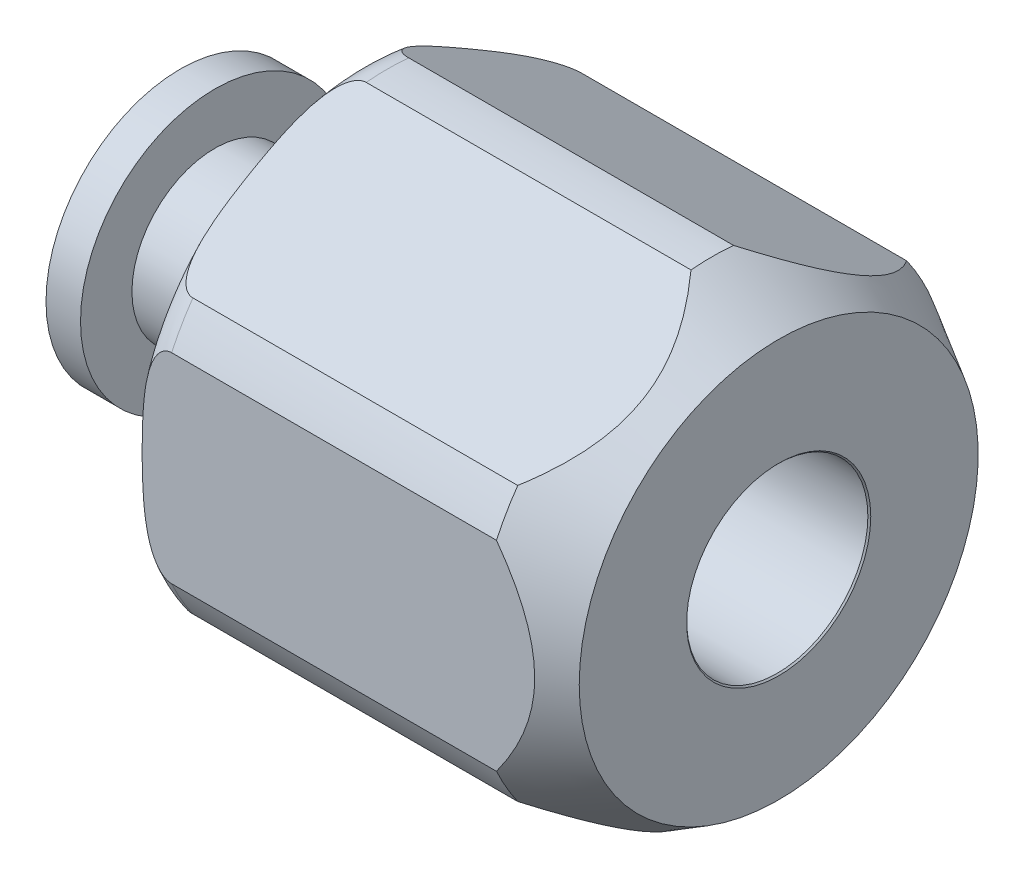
ISO-10303-21;
HEADER;
FILE_DESCRIPTION(('STEP AP214'),'2;1');
FILE_NAME('part.step','',(''),(''),'','','');
FILE_SCHEMA(('AUTOMOTIVE_DESIGN { 1 0 10303 214 1 1 1 1 }'));
ENDSEC;
DATA;
#1=APPLICATION_CONTEXT('core data for automotive mechanical design processes');
#2=APPLICATION_PROTOCOL_DEFINITION('international standard','automotive_design',2000,#1);
#3=PRODUCT_CONTEXT('',#1,'mechanical');
#4=PRODUCT('Part','Part','',(#3));
#5=PRODUCT_RELATED_PRODUCT_CATEGORY('part','',(#4));
#6=PRODUCT_DEFINITION_FORMATION('','',#4);
#7=PRODUCT_DEFINITION_CONTEXT('part definition',#1,'design');
#8=PRODUCT_DEFINITION('design','',#6,#7);
#9=PRODUCT_DEFINITION_SHAPE('','',#8);
#10=(LENGTH_UNIT() NAMED_UNIT(*) SI_UNIT(.MILLI.,.METRE.));
#11=(NAMED_UNIT(*) PLANE_ANGLE_UNIT() SI_UNIT($,.RADIAN.));
#12=(NAMED_UNIT(*) SI_UNIT($,.STERADIAN.) SOLID_ANGLE_UNIT());
#13=UNCERTAINTY_MEASURE_WITH_UNIT(LENGTH_MEASURE(1.E-05),#10,'distance_accuracy_value','');
#14=(GEOMETRIC_REPRESENTATION_CONTEXT(3) GLOBAL_UNCERTAINTY_ASSIGNED_CONTEXT((#13)) GLOBAL_UNIT_ASSIGNED_CONTEXT((#10,
#11,#12)) REPRESENTATION_CONTEXT('',''));
#15=CARTESIAN_POINT('',(0.,0.,0.));
#16=DIRECTION('',(0.,0.,1.));
#17=DIRECTION('',(1.,0.,0.));
#18=AXIS2_PLACEMENT_3D('',#15,#16,#17);
#19=CARTESIAN_POINT('',(0.,0.,0.));
#20=DIRECTION('',(-1.,0.,0.));
#21=DIRECTION('',(0.,0.,1.));
#22=AXIS2_PLACEMENT_3D('',#19,#20,#21);
#23=CYLINDRICAL_SURFACE('',#22,7.874);
#24=CARTESIAN_POINT('',(17.6122954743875,0.,0.));
#25=DIRECTION('',(-1.,0.,0.));
#26=DIRECTION('',(0.,0.,1.));
#27=AXIS2_PLACEMENT_3D('',#24,#25,#26);
#28=CIRCLE('',#27,7.874);
#29=CARTESIAN_POINT('',(17.6122954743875,-3.31160262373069,-7.14375));
#30=VERTEX_POINT('',#29);
#31=CARTESIAN_POINT('',(17.6122954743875,-4.53086766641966,-6.43980699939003));
#32=VERTEX_POINT('',#31);
#33=EDGE_CURVE('E152',#30,#32,#28,.T.);
#34=ORIENTED_EDGE('',*,*,#33,.T.);
#35=DIRECTION('',(-1.,0.,0.));
#36=VECTOR('',#35,1.);
#37=CARTESIAN_POINT('',(0.,-4.53086766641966,-6.43980699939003));
#38=LINE('',#37,#36);
#39=CARTESIAN_POINT('',(6.85800000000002,-4.53086766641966,-6.43980699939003));
#40=VERTEX_POINT('',#39);
#41=EDGE_CURVE('E141',#32,#40,#38,.T.);
#42=ORIENTED_EDGE('',*,*,#41,.T.);
#43=CARTESIAN_POINT('',(6.858,0.,0.));
#44=DIRECTION('',(-1.,0.,0.));
#45=DIRECTION('',(0.,0.,1.));
#46=AXIS2_PLACEMENT_3D('',#43,#44,#45);
#47=CIRCLE('',#46,7.874);
#48=CARTESIAN_POINT('',(6.858,-3.31160262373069,-7.14375));
#49=VERTEX_POINT('',#48);
#50=EDGE_CURVE('E150',#49,#40,#47,.T.);
#51=ORIENTED_EDGE('',*,*,#50,.F.);
#52=DIRECTION('',(-1.,0.,0.));
#53=VECTOR('',#52,1.);
#54=CARTESIAN_POINT('',(0.,-3.31160262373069,-7.14375));
#55=LINE('',#54,#53);
#56=EDGE_CURVE('E724',#49,#30,#55,.F.);
#57=ORIENTED_EDGE('',*,*,#56,.T.);
#58=EDGE_LOOP('',(#34,#42,#51,#57));
#59=FACE_BOUND('',#58,.T.);
#60=ADVANCED_FACE('F16',(#59),#23,.T.);
#61=CARTESIAN_POINT('',(6.858,-7.84247029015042,-0.703943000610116));
#62=VERTEX_POINT('',#61);
#63=CARTESIAN_POINT('',(6.85800000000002,-7.84247029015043,0.703943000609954));
#64=VERTEX_POINT('',#63);
#65=EDGE_CURVE('E162',#62,#64,#47,.T.);
#66=ORIENTED_EDGE('',*,*,#65,.F.);
#67=DIRECTION('',(-1.,0.,0.));
#68=VECTOR('',#67,1.);
#69=CARTESIAN_POINT('',(0.,-7.84247029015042,-0.703943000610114));
#70=LINE('',#69,#68);
#71=CARTESIAN_POINT('',(17.6122954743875,-7.84247029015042,-0.703943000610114));
#72=VERTEX_POINT('',#71);
#73=EDGE_CURVE('E43',#62,#72,#70,.F.);
#74=ORIENTED_EDGE('',*,*,#73,.T.);
#75=CARTESIAN_POINT('',(17.6122954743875,-7.84247029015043,0.703943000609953));
#76=VERTEX_POINT('',#75);
#77=EDGE_CURVE('E693',#72,#76,#28,.T.);
#78=ORIENTED_EDGE('',*,*,#77,.T.);
#79=DIRECTION('',(-1.,0.,0.));
#80=VECTOR('',#79,1.);
#81=CARTESIAN_POINT('',(0.,-7.84247029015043,0.703943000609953));
#82=LINE('',#81,#80);
#83=EDGE_CURVE('E302',#76,#64,#82,.T.);
#84=ORIENTED_EDGE('',*,*,#83,.T.);
#85=EDGE_LOOP('',(#66,#74,#78,#84));
#86=FACE_BOUND('',#85,.T.);
#87=ADVANCED_FACE('F351',(#86),#23,.T.);
#88=CARTESIAN_POINT('',(6.858,-4.5308676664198,6.43980699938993));
#89=VERTEX_POINT('',#88);
#90=CARTESIAN_POINT('',(6.858,-3.31160262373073,7.14374999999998));
#91=VERTEX_POINT('',#90);
#92=EDGE_CURVE('E173',#89,#91,#47,.T.);
#93=ORIENTED_EDGE('',*,*,#92,.F.);
#94=DIRECTION('',(-1.,0.,0.));
#95=VECTOR('',#94,1.);
#96=CARTESIAN_POINT('',(0.,-4.5308676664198,6.43980699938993));
#97=LINE('',#96,#95);
#98=CARTESIAN_POINT('',(17.6122954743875,-4.5308676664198,6.43980699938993));
#99=VERTEX_POINT('',#98);
#100=EDGE_CURVE('E52',#89,#99,#97,.F.);
#101=ORIENTED_EDGE('',*,*,#100,.T.);
#102=CARTESIAN_POINT('',(17.6122954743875,-3.31160262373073,7.14374999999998));
#103=VERTEX_POINT('',#102);
#104=EDGE_CURVE('E696',#99,#103,#28,.T.);
#105=ORIENTED_EDGE('',*,*,#104,.T.);
#106=DIRECTION('',(-1.,0.,0.));
#107=VECTOR('',#106,1.);
#108=CARTESIAN_POINT('',(0.,-3.31160262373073,7.14374999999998));
#109=LINE('',#108,#107);
#110=EDGE_CURVE('E307',#103,#91,#109,.T.);
#111=ORIENTED_EDGE('',*,*,#110,.T.);
#112=EDGE_LOOP('',(#93,#101,#105,#111));
#113=FACE_BOUND('',#112,.T.);
#114=ADVANCED_FACE('F356',(#113),#23,.T.);
#115=CARTESIAN_POINT('',(6.858,3.31160262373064,7.14375000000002));
#116=VERTEX_POINT('',#115);
#117=CARTESIAN_POINT('',(6.85800000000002,4.53086766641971,6.43980699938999));
#118=VERTEX_POINT('',#117);
#119=EDGE_CURVE('E185',#116,#118,#47,.T.);
#120=ORIENTED_EDGE('',*,*,#119,.F.);
#121=DIRECTION('',(-1.,0.,0.));
#122=VECTOR('',#121,1.);
#123=CARTESIAN_POINT('',(0.,3.31160262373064,7.14375000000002));
#124=LINE('',#123,#122);
#125=CARTESIAN_POINT('',(17.6122954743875,3.31160262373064,7.14375000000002));
#126=VERTEX_POINT('',#125);
#127=EDGE_CURVE('E301',#116,#126,#124,.F.);
#128=ORIENTED_EDGE('',*,*,#127,.T.);
#129=CARTESIAN_POINT('',(17.6122954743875,4.53086766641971,6.43980699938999));
#130=VERTEX_POINT('',#129);
#131=EDGE_CURVE('E710',#126,#130,#28,.T.);
#132=ORIENTED_EDGE('',*,*,#131,.T.);
#133=DIRECTION('',(-1.,0.,0.));
#134=VECTOR('',#133,1.);
#135=CARTESIAN_POINT('',(0.,4.53086766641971,6.43980699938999));
#136=LINE('',#135,#134);
#137=EDGE_CURVE('E323',#130,#118,#136,.T.);
#138=ORIENTED_EDGE('',*,*,#137,.T.);
#139=EDGE_LOOP('',(#120,#128,#132,#138));
#140=FACE_BOUND('',#139,.T.);
#141=ADVANCED_FACE('F367',(#140),#23,.T.);
#142=CARTESIAN_POINT('',(6.858,7.84247029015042,0.703943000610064));
#143=VERTEX_POINT('',#142);
#144=CARTESIAN_POINT('',(6.85800000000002,7.84247029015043,-0.703943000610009));
#145=VERTEX_POINT('',#144);
#146=EDGE_CURVE('E176',#143,#145,#47,.T.);
#147=ORIENTED_EDGE('',*,*,#146,.F.);
#148=DIRECTION('',(-1.,0.,0.));
#149=VECTOR('',#148,1.);
#150=CARTESIAN_POINT('',(0.,7.84247029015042,0.703943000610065));
#151=LINE('',#150,#149);
#152=CARTESIAN_POINT('',(17.6122954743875,7.84247029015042,0.703943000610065));
#153=VERTEX_POINT('',#152);
#154=EDGE_CURVE('E319',#143,#153,#151,.F.);
#155=ORIENTED_EDGE('',*,*,#154,.T.);
#156=CARTESIAN_POINT('',(17.6122954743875,7.84247029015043,-0.703943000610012));
#157=VERTEX_POINT('',#156);
#158=EDGE_CURVE('E170',#153,#157,#28,.T.);
#159=ORIENTED_EDGE('',*,*,#158,.T.);
#160=DIRECTION('',(-1.,0.,0.));
#161=VECTOR('',#160,1.);
#162=CARTESIAN_POINT('',(0.,7.84247029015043,-0.703943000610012));
#163=LINE('',#162,#161);
#164=EDGE_CURVE('E380',#157,#145,#163,.T.);
#165=ORIENTED_EDGE('',*,*,#164,.T.);
#166=EDGE_LOOP('',(#147,#155,#159,#165));
#167=FACE_BOUND('',#166,.T.);
#168=ADVANCED_FACE('F360',(#167),#23,.T.);
#169=CARTESIAN_POINT('',(19.812,6.604,0.));
#170=DIRECTION('',(-1.,0.,0.));
#171=DIRECTION('',(0.,0.,1.));
#172=AXIS2_PLACEMENT_3D('',#169,#170,#171);
#173=PLANE('',#172);
#174=CARTESIAN_POINT('',(19.812,0.,0.));
#175=DIRECTION('',(1.,0.,0.));
#176=DIRECTION('',(0.,0.,-1.));
#177=AXIS2_PLACEMENT_3D('',#174,#175,#176);
#178=CIRCLE('',#177,3.048);
#179=CARTESIAN_POINT('',(19.812,0.,-3.048));
#180=VERTEX_POINT('',#179);
#181=EDGE_CURVE('E753',#180,#180,#178,.T.);
#182=ORIENTED_EDGE('',*,*,#181,.F.);
#183=EDGE_LOOP('',(#182));
#184=FACE_BOUND('',#183,.T.);
#185=CARTESIAN_POINT('',(19.812,0.,0.));
#186=DIRECTION('',(-1.,0.,0.));
#187=DIRECTION('',(0.,0.,1.));
#188=AXIS2_PLACEMENT_3D('',#185,#186,#187);
#189=CIRCLE('',#188,6.604);
#190=CARTESIAN_POINT('',(19.812,0.,6.604));
#191=VERTEX_POINT('',#190);
#192=EDGE_CURVE('E249',#191,#191,#189,.T.);
#193=ORIENTED_EDGE('',*,*,#192,.F.);
#194=EDGE_LOOP('',(#193));
#195=FACE_BOUND('',#194,.T.);
#196=ADVANCED_FACE('F18',(#184,#195),#173,.F.);
#197=CARTESIAN_POINT('',(19.812,0.,0.));
#198=DIRECTION('',(-1.,0.,0.));
#199=DIRECTION('',(0.,0.,1.));
#200=AXIS2_PLACEMENT_3D('',#197,#198,#199);
#201=CONICAL_SURFACE('',#200,6.604,0.523598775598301);
#202=ORIENTED_EDGE('',*,*,#77,.F.);
#203=CARTESIAN_POINT('',(17.6120954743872,-7.8426075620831,-0.703705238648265));
#204=CARTESIAN_POINT('',(17.7182867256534,-7.76967395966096,-0.830029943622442));
#205=CARTESIAN_POINT('',(17.8208825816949,-7.69534092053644,-0.958778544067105));
#206=CARTESIAN_POINT('',(18.0169565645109,-7.54334014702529,-1.22205160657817));
#207=CARTESIAN_POINT('',(18.1103985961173,-7.46566082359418,-1.35659614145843));
#208=CARTESIAN_POINT('',(18.28696912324,-7.30555568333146,-1.63390637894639));
#209=CARTESIAN_POINT('',(18.3698820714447,-7.22306965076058,-1.77677637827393));
#210=CARTESIAN_POINT('',(18.5201004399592,-7.05470419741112,-2.06839389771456));
#211=CARTESIAN_POINT('',(18.5874295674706,-6.96883016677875,-2.21713208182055));
#212=CARTESIAN_POINT('',(18.6838619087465,-6.82302518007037,-2.46967372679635));
#213=CARTESIAN_POINT('',(18.7182315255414,-6.76396233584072,-2.57197357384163));
#214=CARTESIAN_POINT('',(18.777509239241,-6.64464423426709,-2.77863858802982));
#215=CARTESIAN_POINT('',(18.8024169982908,-6.58438893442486,-2.88300382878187));
#216=CARTESIAN_POINT('',(18.8417384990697,-6.4635555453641,-3.09229339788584));
#217=CARTESIAN_POINT('',(18.8562409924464,-6.40298473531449,-3.19720511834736));
#218=CARTESIAN_POINT('',(18.8745576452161,-6.28143917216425,-3.40772820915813));
#219=CARTESIAN_POINT('',(18.8783723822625,-6.22046444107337,-3.51333954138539));
#220=CARTESIAN_POINT('',(18.8751617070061,-6.09849020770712,-3.72460511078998));
#221=CARTESIAN_POINT('',(18.8681190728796,-6.03749081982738,-3.83025914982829));
#222=CARTESIAN_POINT('',(18.8434372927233,-5.91603259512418,-4.04063096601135));
#223=CARTESIAN_POINT('',(18.8257975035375,-5.85557379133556,-4.14534868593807));
#224=CARTESIAN_POINT('',(18.7803707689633,-5.73508446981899,-4.35404231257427));
#225=CARTESIAN_POINT('',(18.752497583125,-5.67506214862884,-4.45800402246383));
#226=CARTESIAN_POINT('',(18.6875532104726,-5.55629102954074,-4.66372163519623));
#227=CARTESIAN_POINT('',(18.6504822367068,-5.49754220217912,-4.76547758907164));
#228=CARTESIAN_POINT('',(18.5508666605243,-5.35709210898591,-5.00874428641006));
#229=CARTESIAN_POINT('',(18.4841652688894,-5.27612719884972,-5.14897962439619));
#230=CARTESIAN_POINT('',(18.3371977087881,-5.11726876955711,-5.42413049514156));
#231=CARTESIAN_POINT('',(18.2569151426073,-5.03937910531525,-5.55903935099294));
#232=CARTESIAN_POINT('',(18.0870283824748,-4.88804670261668,-5.82115476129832));
#233=CARTESIAN_POINT('',(17.9976164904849,-4.81454935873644,-5.94845589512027));
#234=CARTESIAN_POINT('',(17.8105707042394,-4.67053081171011,-6.19790333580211));
#235=CARTESIAN_POINT('',(17.7129631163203,-4.6000011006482,-6.32006437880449));
#236=CARTESIAN_POINT('',(17.6120954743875,-4.5307303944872,-6.4400447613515));
#237=B_SPLINE_CURVE_WITH_KNOTS('',3,(#203,#204,#205,#206,#207,#208,#209,#210,#211,#212,#213,
#214,#215,#216,#217,#218,#219,#220,#221,#222,#223,#224,#225,#226,#227,#228,#229,#230,#231,#232,
#233,#234,#235,#236),.UNSPECIFIED.,.F.,.F.,(4,2,2,2,2,2,2,2,2,2,2,2,2,2,2,2,4),(0.,
0.541444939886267,1.08494552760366,1.63821435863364,2.19063590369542,2.55937243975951,
2.92812214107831,3.29368794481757,3.65923399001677,4.0253604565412,4.39150914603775,
4.76081711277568,5.13011652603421,5.65470457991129,6.1799305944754,6.69576705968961,
7.21000684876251),.UNSPECIFIED.);
#238=EDGE_CURVE('E154',#72,#32,#237,.T.);
#239=ORIENTED_EDGE('',*,*,#238,.T.);
#240=ORIENTED_EDGE('',*,*,#33,.F.);
#241=CARTESIAN_POINT('',(10.0810282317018,-9.91708120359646,-7.14375));
#242=CARTESIAN_POINT('',(10.3227849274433,-9.74504144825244,-7.14375));
#243=CARTESIAN_POINT('',(10.5638394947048,-9.5720072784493,-7.14375));
#244=CARTESIAN_POINT('',(11.0442737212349,-9.22359731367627,-7.14375));
#245=CARTESIAN_POINT('',(11.2836532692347,-9.04822136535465,-7.14375));
#246=CARTESIAN_POINT('',(11.7610215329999,-8.69436275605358,-7.14375));
#247=CARTESIAN_POINT('',(11.9990053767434,-8.51587351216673,-7.14375));
#248=CARTESIAN_POINT('',(12.4725963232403,-8.15577526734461,-7.14375));
#249=CARTESIAN_POINT('',(12.7082034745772,-7.97416633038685,-7.14375));
#250=CARTESIAN_POINT('',(13.194480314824,-7.59325390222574,-7.14375));
#251=CARTESIAN_POINT('',(13.4449229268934,-7.39365985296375,-7.14375));
#252=CARTESIAN_POINT('',(13.9416834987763,-6.98940362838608,-7.14375));
#253=CARTESIAN_POINT('',(14.1880015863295,-6.78474161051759,-7.14375));
#254=CARTESIAN_POINT('',(14.6751400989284,-6.36950531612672,-7.14375));
#255=CARTESIAN_POINT('',(14.9159663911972,-6.15893794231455,-7.14375));
#256=CARTESIAN_POINT('',(15.3908521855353,-5.73031003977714,-7.14375));
#257=CARTESIAN_POINT('',(15.6249125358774,-5.51225045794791,-7.14375));
#258=CARTESIAN_POINT('',(15.9855215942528,-5.16236879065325,-7.14375));
#259=CARTESIAN_POINT('',(16.1151148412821,-5.03368407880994,-7.14375));
#260=CARTESIAN_POINT('',(16.370769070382,-4.77285875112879,-7.14375));
#261=CARTESIAN_POINT('',(16.4968302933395,-4.64071837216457,-7.14375));
#262=CARTESIAN_POINT('',(16.744905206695,-4.37227821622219,-7.14375));
#263=CARTESIAN_POINT('',(16.8669119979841,-4.23597203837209,-7.14375));
#264=CARTESIAN_POINT('',(17.1057121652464,-3.95886572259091,-7.14375));
#265=CARTESIAN_POINT('',(17.2225057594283,-3.8180657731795,-7.14375));
#266=CARTESIAN_POINT('',(17.4474021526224,-3.53420549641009,-7.14375));
#267=CARTESIAN_POINT('',(17.5556323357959,-3.39124725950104,-7.14375));
#268=CARTESIAN_POINT('',(17.7644011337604,-3.0998494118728,-7.14375));
#269=CARTESIAN_POINT('',(17.8649381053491,-2.95140864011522,-7.14375));
#270=CARTESIAN_POINT('',(18.1516948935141,-2.49771994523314,-7.14375));
#271=CARTESIAN_POINT('',(18.3239849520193,-2.18298526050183,-7.14375));
#272=CARTESIAN_POINT('',(18.5174506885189,-1.7386144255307,-7.14375));
#273=CARTESIAN_POINT('',(18.5645524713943,-1.62010938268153,-7.14375));
#274=CARTESIAN_POINT('',(18.6500353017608,-1.37994540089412,-7.14375));
#275=CARTESIAN_POINT('',(18.6884159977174,-1.25828633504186,-7.14375));
#276=CARTESIAN_POINT('',(18.7552508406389,-1.01241998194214,-7.14375));
#277=CARTESIAN_POINT('',(18.7837177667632,-0.888216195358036,-7.14375));
#278=CARTESIAN_POINT('',(18.8297774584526,-0.637812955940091,-7.14375));
#279=CARTESIAN_POINT('',(18.8473724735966,-0.511613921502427,-7.14375));
#280=CARTESIAN_POINT('',(18.8710774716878,-0.25719594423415,-7.14375));
#281=CARTESIAN_POINT('',(18.8771023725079,-0.128968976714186,-7.14375));
#282=CARTESIAN_POINT('',(18.877148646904,0.127483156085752,-7.14375));
#283=CARTESIAN_POINT('',(18.8711703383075,0.255708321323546,-7.14375));
#284=CARTESIAN_POINT('',(18.84746231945,0.51113530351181,-7.14375));
#285=CARTESIAN_POINT('',(18.8297254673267,0.638336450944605,-7.14375));
#286=CARTESIAN_POINT('',(18.7832166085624,0.890696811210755,-7.14375));
#287=CARTESIAN_POINT('',(18.7544429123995,1.01585570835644,-7.14375));
#288=CARTESIAN_POINT('',(18.6779291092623,1.29625915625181,-7.14375));
#289=CARTESIAN_POINT('',(18.6271830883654,1.45068274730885,-7.14375));
#290=CARTESIAN_POINT('',(18.5120671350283,1.75434890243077,-7.14375));
#291=CARTESIAN_POINT('',(18.4476917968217,1.9035893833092,-7.14375));
#292=CARTESIAN_POINT('',(18.307007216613,2.19804834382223,-7.14375));
#293=CARTESIAN_POINT('',(18.2305892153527,2.3432143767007,-7.14375));
#294=CARTESIAN_POINT('',(18.068416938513,2.62812651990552,-7.14375));
#295=CARTESIAN_POINT('',(17.9826652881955,2.76787413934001,-7.14375));
#296=CARTESIAN_POINT('',(17.7678396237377,3.09713246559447,-7.14375));
#297=CARTESIAN_POINT('',(17.6351271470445,3.28426197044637,-7.14375));
#298=CARTESIAN_POINT('',(17.3584667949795,3.65008267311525,-7.14375));
#299=CARTESIAN_POINT('',(17.2145123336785,3.82876882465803,-7.14375));
#300=CARTESIAN_POINT('',(16.9175273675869,4.17947281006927,-7.14375));
#301=CARTESIAN_POINT('',(16.7644665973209,4.35146485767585,-7.14375));
#302=CARTESIAN_POINT('',(16.4516893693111,4.68918131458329,-7.14375));
#303=CARTESIAN_POINT('',(16.2919743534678,4.85490706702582,-7.14375));
#304=CARTESIAN_POINT('',(15.9763629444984,5.17191841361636,-7.14375));
#305=CARTESIAN_POINT('',(15.8207550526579,5.32349250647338,-7.14375));
#306=CARTESIAN_POINT('',(15.5056850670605,5.62259762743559,-7.14375));
#307=CARTESIAN_POINT('',(15.3462226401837,5.77012830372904,-7.14375));
#308=CARTESIAN_POINT('',(15.0255062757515,6.06044517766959,-7.14375));
#309=CARTESIAN_POINT('',(14.8642791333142,6.20326106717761,-7.14375));
#310=CARTESIAN_POINT('',(14.5392457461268,6.48584269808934,-7.14375));
#311=CARTESIAN_POINT('',(14.3754401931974,6.62560923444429,-7.14375));
#312=CARTESIAN_POINT('',(14.2105673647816,6.76408577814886,-7.14375));
#313=B_SPLINE_CURVE_WITH_KNOTS('',3,(#241,#242,#243,#244,#245,#246,#247,#248,#249,#250,#251,
#252,#253,#254,#255,#256,#257,#258,#259,#260,#261,#262,#263,#264,#265,#266,#267,#268,#269,#270,
#271,#272,#273,#274,#275,#276,#277,#278,#279,#280,#281,#282,#283,#284,#285,#286,#287,#288,#289,
#290,#291,#292,#293,#294,#295,#296,#297,#298,#299,#300,#301,#302,#303,#304,#305,#306,#307,#308,
#309,#310,#311,#312),.UNSPECIFIED.,.F.,.F.,(4,2,2,2,2,2,2,2,2,2,2,2,2,2,2,2,2,2,2,2,2,2,2,2,2,2,
2,2,2,2,2,2,2,2,2,4),(0.,0.890170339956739,1.78039926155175,2.67281882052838,3.56522009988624,
4.5259125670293,5.48657522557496,6.44615828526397,7.40562051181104,7.95346054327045,
8.50126312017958,9.04995452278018,9.59862293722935,10.1362789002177,10.6740493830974,
11.7452519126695,12.1275604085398,12.5098843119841,12.8917135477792,13.2734637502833,
13.6580106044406,14.042547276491,14.4273177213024,14.8121470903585,15.2990026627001,
15.7860516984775,16.2777821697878,16.7693746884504,17.4570227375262,18.145076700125,
18.835561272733,19.5258969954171,20.1775014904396,20.829162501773,21.4752777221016,
22.1212224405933),.UNSPECIFIED.);
#314=CARTESIAN_POINT('',(17.6122954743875,3.31160262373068,-7.14375));
#315=VERTEX_POINT('',#314);
#316=EDGE_CURVE('E215',#30,#315,#313,.T.);
#317=ORIENTED_EDGE('',*,*,#316,.T.);
#318=CARTESIAN_POINT('',(17.6122954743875,4.53086766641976,-6.43980699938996));
#319=VERTEX_POINT('',#318);
#320=EDGE_CURVE('E161',#319,#315,#28,.T.);
#321=ORIENTED_EDGE('',*,*,#320,.F.);
#322=CARTESIAN_POINT('',(17.6120954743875,4.5307303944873,-6.44004476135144));
#323=CARTESIAN_POINT('',(17.7182867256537,4.60366399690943,-6.31372005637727));
#324=CARTESIAN_POINT('',(17.8208825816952,4.67799703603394,-6.18497145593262));
#325=CARTESIAN_POINT('',(18.0169565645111,4.82999780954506,-5.92169839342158));
#326=CARTESIAN_POINT('',(18.1103985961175,4.90767713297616,-5.78715385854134));
#327=CARTESIAN_POINT('',(18.2869691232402,5.06778227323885,-5.50984362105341));
#328=CARTESIAN_POINT('',(18.3698820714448,5.15026830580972,-5.36697362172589));
#329=CARTESIAN_POINT('',(18.5201004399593,5.31863375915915,-5.0753561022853));
#330=CARTESIAN_POINT('',(18.5874295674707,5.40450778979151,-4.92661791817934));
#331=CARTESIAN_POINT('',(18.6838619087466,5.55031277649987,-4.67407627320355));
#332=CARTESIAN_POINT('',(18.7182315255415,5.60937562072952,-4.57177642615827));
#333=CARTESIAN_POINT('',(18.7775092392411,5.72869372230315,-4.36511141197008));
#334=CARTESIAN_POINT('',(18.8024169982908,5.78894902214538,-4.26074617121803));
#335=CARTESIAN_POINT('',(18.8417384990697,5.90978241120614,-4.05145660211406));
#336=CARTESIAN_POINT('',(18.8562409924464,5.97035322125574,-3.94654488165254));
#337=CARTESIAN_POINT('',(18.8745576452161,6.09189878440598,-3.73602179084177));
#338=CARTESIAN_POINT('',(18.8783723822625,6.15287351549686,-3.63041045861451));
#339=CARTESIAN_POINT('',(18.8751617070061,6.2748477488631,-3.41914488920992));
#340=CARTESIAN_POINT('',(18.8681190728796,6.33584713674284,-3.31349085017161));
#341=CARTESIAN_POINT('',(18.8434372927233,6.45730536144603,-3.10311903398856));
#342=CARTESIAN_POINT('',(18.8257975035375,6.51776416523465,-2.99840131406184));
#343=CARTESIAN_POINT('',(18.7803707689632,6.63825348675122,-2.78970768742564));
#344=CARTESIAN_POINT('',(18.752497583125,6.69827580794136,-2.68574597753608));
#345=CARTESIAN_POINT('',(18.6875532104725,6.81704692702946,-2.48002836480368));
#346=CARTESIAN_POINT('',(18.6504822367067,6.87579575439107,-2.37827241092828));
#347=CARTESIAN_POINT('',(18.5508666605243,7.01624584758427,-2.13500571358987));
#348=CARTESIAN_POINT('',(18.4841652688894,7.09721075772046,-1.99477037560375));
#349=CARTESIAN_POINT('',(18.337197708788,7.25606918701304,-1.7196195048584));
#350=CARTESIAN_POINT('',(18.2569151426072,7.3339588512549,-1.58471064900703));
#351=CARTESIAN_POINT('',(18.0870283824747,7.48529125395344,-1.32259523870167));
#352=CARTESIAN_POINT('',(17.9976164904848,7.55878859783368,-1.19529410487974));
#353=CARTESIAN_POINT('',(17.8105707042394,7.70280714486,-0.945846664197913));
#354=CARTESIAN_POINT('',(17.7129631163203,7.7733368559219,-0.823685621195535));
#355=CARTESIAN_POINT('',(17.6120954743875,7.84260756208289,-0.703705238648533));
#356=B_SPLINE_CURVE_WITH_KNOTS('',3,(#322,#323,#324,#325,#326,#327,#328,#329,#330,#331,#332,
#333,#334,#335,#336,#337,#338,#339,#340,#341,#342,#343,#344,#345,#346,#347,#348,#349,#350,#351,
#352,#353,#354,#355),.UNSPECIFIED.,.F.,.F.,(4,2,2,2,2,2,2,2,2,2,2,2,2,2,2,2,4),(0.,
0.541444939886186,1.0849455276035,1.63821435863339,2.19063590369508,2.55937243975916,
2.92812214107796,3.29368794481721,3.65923399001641,4.02536045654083,4.39150914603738,
4.7608171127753,5.13011652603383,5.65470457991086,6.17993059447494,6.69576705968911,
7.21000684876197),.UNSPECIFIED.);
#357=EDGE_CURVE('E721',#319,#157,#356,.T.);
#358=ORIENTED_EDGE('',*,*,#357,.T.);
#359=ORIENTED_EDGE('',*,*,#158,.F.);
#360=CARTESIAN_POINT('',(17.6120954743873,7.84260756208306,0.703705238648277));
#361=CARTESIAN_POINT('',(17.7182867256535,7.76967395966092,0.830029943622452));
#362=CARTESIAN_POINT('',(17.8208825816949,7.69534092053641,0.958778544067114));
#363=CARTESIAN_POINT('',(18.0169565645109,7.54334014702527,1.22205160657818));
#364=CARTESIAN_POINT('',(18.1103985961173,7.46566082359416,1.35659614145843));
#365=CARTESIAN_POINT('',(18.28696912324,7.30555568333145,1.63390637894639));
#366=CARTESIAN_POINT('',(18.3698820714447,7.22306965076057,1.77677637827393));
#367=CARTESIAN_POINT('',(18.5201004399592,7.05470419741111,2.06839389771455));
#368=CARTESIAN_POINT('',(18.5874295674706,6.96883016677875,2.21713208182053));
#369=CARTESIAN_POINT('',(18.6838619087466,6.82302518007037,2.46967372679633));
#370=CARTESIAN_POINT('',(18.7182315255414,6.76396233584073,2.57197357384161));
#371=CARTESIAN_POINT('',(18.777509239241,6.6446442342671,2.7786385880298));
#372=CARTESIAN_POINT('',(18.8024169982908,6.58438893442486,2.88300382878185));
#373=CARTESIAN_POINT('',(18.8417384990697,6.4635555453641,3.09229339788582));
#374=CARTESIAN_POINT('',(18.8562409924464,6.4029847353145,3.19720511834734));
#375=CARTESIAN_POINT('',(18.874557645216,6.28143917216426,3.40772820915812));
#376=CARTESIAN_POINT('',(18.8783723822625,6.22046444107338,3.51333954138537));
#377=CARTESIAN_POINT('',(18.8751617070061,6.09849020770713,3.72460511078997));
#378=CARTESIAN_POINT('',(18.8681190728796,6.0374908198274,3.83025914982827));
#379=CARTESIAN_POINT('',(18.8434372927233,5.9160325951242,4.04063096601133));
#380=CARTESIAN_POINT('',(18.8257975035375,5.85557379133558,4.14534868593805));
#381=CARTESIAN_POINT('',(18.7803707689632,5.73508446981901,4.35404231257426));
#382=CARTESIAN_POINT('',(18.752497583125,5.67506214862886,4.45800402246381));
#383=CARTESIAN_POINT('',(18.6875532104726,5.55629102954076,4.66372163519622));
#384=CARTESIAN_POINT('',(18.6504822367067,5.49754220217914,4.76547758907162));
#385=CARTESIAN_POINT('',(18.5508666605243,5.35709210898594,5.00874428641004));
#386=CARTESIAN_POINT('',(18.4841652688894,5.27612719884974,5.14897962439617));
#387=CARTESIAN_POINT('',(18.3371977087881,5.11726876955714,5.42413049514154));
#388=CARTESIAN_POINT('',(18.2569151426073,5.03937910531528,5.55903935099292));
#389=CARTESIAN_POINT('',(18.0870283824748,4.88804670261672,5.8211547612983));
#390=CARTESIAN_POINT('',(17.9976164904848,4.81454935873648,5.94845589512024));
#391=CARTESIAN_POINT('',(17.8105707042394,4.67053081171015,6.19790333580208));
#392=CARTESIAN_POINT('',(17.7129631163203,4.60000110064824,6.32006437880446));
#393=CARTESIAN_POINT('',(17.6120954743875,4.53073039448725,6.44004476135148));
#394=B_SPLINE_CURVE_WITH_KNOTS('',3,(#360,#361,#362,#363,#364,#365,#366,#367,#368,#369,#370,
#371,#372,#373,#374,#375,#376,#377,#378,#379,#380,#381,#382,#383,#384,#385,#386,#387,#388,#389,
#390,#391,#392,#393),.UNSPECIFIED.,.F.,.F.,(4,2,2,2,2,2,2,2,2,2,2,2,2,2,2,2,4),(0.,
0.541444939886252,1.08494552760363,1.63821435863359,2.19063590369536,2.55937243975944,
2.92812214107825,3.2936879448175,3.6592339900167,4.02536045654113,4.39150914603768,
4.76081711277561,5.13011652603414,5.65470457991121,6.17993059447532,6.69576705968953,
7.21000684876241),.UNSPECIFIED.);
#395=EDGE_CURVE('E327',#153,#130,#394,.T.);
#396=ORIENTED_EDGE('',*,*,#395,.T.);
#397=ORIENTED_EDGE('',*,*,#131,.F.);
#398=CARTESIAN_POINT('',(10.081028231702,-9.91708120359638,7.14374999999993));
#399=CARTESIAN_POINT('',(10.3227849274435,-9.74504144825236,7.14374999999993));
#400=CARTESIAN_POINT('',(10.563839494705,-9.57200727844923,7.14374999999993));
#401=CARTESIAN_POINT('',(11.0442737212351,-9.2235973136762,7.14374999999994));
#402=CARTESIAN_POINT('',(11.2836532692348,-9.04822136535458,7.14374999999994));
#403=CARTESIAN_POINT('',(11.7610215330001,-8.69436275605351,7.14374999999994));
#404=CARTESIAN_POINT('',(11.9990053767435,-8.51587351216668,7.14374999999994));
#405=CARTESIAN_POINT('',(12.4725963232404,-8.15577526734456,7.14374999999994));
#406=CARTESIAN_POINT('',(12.7082034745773,-7.9741663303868,7.14374999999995));
#407=CARTESIAN_POINT('',(13.1944803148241,-7.5932539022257,7.14374999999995));
#408=CARTESIAN_POINT('',(13.4449229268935,-7.39365985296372,7.14374999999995));
#409=CARTESIAN_POINT('',(13.9416834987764,-6.98940362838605,7.14374999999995));
#410=CARTESIAN_POINT('',(14.1880015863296,-6.78474161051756,7.14374999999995));
#411=CARTESIAN_POINT('',(14.6751400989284,-6.3695053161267,7.14374999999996));
#412=CARTESIAN_POINT('',(14.9159663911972,-6.15893794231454,7.14374999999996));
#413=CARTESIAN_POINT('',(15.3908521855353,-5.73031003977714,7.14374999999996));
#414=CARTESIAN_POINT('',(15.6249125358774,-5.51225045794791,7.14374999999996));
#415=CARTESIAN_POINT('',(15.9855215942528,-5.16236879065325,7.14374999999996));
#416=CARTESIAN_POINT('',(16.1151148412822,-5.03368407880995,7.14374999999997));
#417=CARTESIAN_POINT('',(16.370769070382,-4.7728587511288,7.14374999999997));
#418=CARTESIAN_POINT('',(16.4968302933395,-4.64071837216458,7.14374999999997));
#419=CARTESIAN_POINT('',(16.744905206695,-4.3722782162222,7.14374999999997));
#420=CARTESIAN_POINT('',(16.8669119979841,-4.23597203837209,7.14374999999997));
#421=CARTESIAN_POINT('',(17.1057121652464,-3.95886572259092,7.14374999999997));
#422=CARTESIAN_POINT('',(17.2225057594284,-3.81806577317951,7.14374999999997));
#423=CARTESIAN_POINT('',(17.4474021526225,-3.5342054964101,7.14374999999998));
#424=CARTESIAN_POINT('',(17.5556323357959,-3.39124725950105,7.14374999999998));
#425=CARTESIAN_POINT('',(17.7644011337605,-3.09984941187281,7.14374999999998));
#426=CARTESIAN_POINT('',(17.8649381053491,-2.95140864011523,7.14374999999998));
#427=CARTESIAN_POINT('',(18.1516948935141,-2.49771994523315,7.14374999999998));
#428=CARTESIAN_POINT('',(18.3239849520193,-2.18298526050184,7.14374999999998));
#429=CARTESIAN_POINT('',(18.5174506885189,-1.73861442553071,7.14374999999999));
#430=CARTESIAN_POINT('',(18.5645524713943,-1.62010938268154,7.14374999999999));
#431=CARTESIAN_POINT('',(18.6500353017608,-1.37994540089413,7.14374999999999));
#432=CARTESIAN_POINT('',(18.6884159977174,-1.25828633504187,7.14374999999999));
#433=CARTESIAN_POINT('',(18.7552508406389,-1.01241998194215,7.14374999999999));
#434=CARTESIAN_POINT('',(18.7837177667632,-0.888216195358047,7.14374999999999));
#435=CARTESIAN_POINT('',(18.8297774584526,-0.637812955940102,7.14375));
#436=CARTESIAN_POINT('',(18.8473724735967,-0.511613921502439,7.14375));
#437=CARTESIAN_POINT('',(18.8710774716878,-0.257195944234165,7.14375));
#438=CARTESIAN_POINT('',(18.8771023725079,-0.128968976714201,7.14375));
#439=CARTESIAN_POINT('',(18.877148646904,0.127483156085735,7.14375));
#440=CARTESIAN_POINT('',(18.8711703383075,0.255708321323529,7.14375));
#441=CARTESIAN_POINT('',(18.84746231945,0.511135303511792,7.14375));
#442=CARTESIAN_POINT('',(18.8297254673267,0.638336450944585,7.14375));
#443=CARTESIAN_POINT('',(18.7832166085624,0.890696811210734,7.14375000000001));
#444=CARTESIAN_POINT('',(18.7544429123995,1.01585570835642,7.14375000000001));
#445=CARTESIAN_POINT('',(18.6779291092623,1.29625915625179,7.14375000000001));
#446=CARTESIAN_POINT('',(18.6271830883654,1.45068274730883,7.14375000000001));
#447=CARTESIAN_POINT('',(18.5120671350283,1.75434890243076,7.14375000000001));
#448=CARTESIAN_POINT('',(18.4476917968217,1.90358938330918,7.14375000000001));
#449=CARTESIAN_POINT('',(18.3070072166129,2.19804834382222,7.14375000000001));
#450=CARTESIAN_POINT('',(18.2305892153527,2.34321437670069,7.14375000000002));
#451=CARTESIAN_POINT('',(18.068416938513,2.62812651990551,7.14375000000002));
#452=CARTESIAN_POINT('',(17.9826652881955,2.76787413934,7.14375000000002));
#453=CARTESIAN_POINT('',(17.7678396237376,3.09713246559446,7.14375000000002));
#454=CARTESIAN_POINT('',(17.6351271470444,3.28426197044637,7.14375000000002));
#455=CARTESIAN_POINT('',(17.3584667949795,3.65008267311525,7.14375000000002));
#456=CARTESIAN_POINT('',(17.2145123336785,3.82876882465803,7.14375000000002));
#457=CARTESIAN_POINT('',(16.9175273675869,4.17947281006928,7.14375000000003));
#458=CARTESIAN_POINT('',(16.7644665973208,4.35146485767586,7.14375000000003));
#459=CARTESIAN_POINT('',(16.451689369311,4.68918131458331,7.14375000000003));
#460=CARTESIAN_POINT('',(16.2919743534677,4.85490706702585,7.14375000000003));
#461=CARTESIAN_POINT('',(15.9763629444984,5.1719184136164,7.14375000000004));
#462=CARTESIAN_POINT('',(15.8207550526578,5.32349250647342,7.14375000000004));
#463=CARTESIAN_POINT('',(15.5056850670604,5.62259762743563,7.14375000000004));
#464=CARTESIAN_POINT('',(15.3462226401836,5.77012830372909,7.14375000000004));
#465=CARTESIAN_POINT('',(15.0255062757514,6.06044517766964,7.14375000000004));
#466=CARTESIAN_POINT('',(14.8642791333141,6.20326106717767,7.14375000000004));
#467=CARTESIAN_POINT('',(14.5392457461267,6.4858426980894,7.14375000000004));
#468=CARTESIAN_POINT('',(14.3754401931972,6.62560923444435,7.14375000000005));
#469=CARTESIAN_POINT('',(14.2105673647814,6.76408577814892,7.14375000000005));
#470=B_SPLINE_CURVE_WITH_KNOTS('',3,(#398,#399,#400,#401,#402,#403,#404,#405,#406,#407,#408,
#409,#410,#411,#412,#413,#414,#415,#416,#417,#418,#419,#420,#421,#422,#423,#424,#425,#426,#427,
#428,#429,#430,#431,#432,#433,#434,#435,#436,#437,#438,#439,#440,#441,#442,#443,#444,#445,#446,
#447,#448,#449,#450,#451,#452,#453,#454,#455,#456,#457,#458,#459,#460,#461,#462,#463,#464,#465,
#466,#467,#468,#469),.UNSPECIFIED.,.F.,.F.,(4,2,2,2,2,2,2,2,2,2,2,2,2,2,2,2,2,2,2,2,2,2,2,2,2,2,
2,2,2,2,2,2,2,2,2,4),(0.,0.890170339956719,1.78039926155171,2.67281882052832,3.56522009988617,
4.52591256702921,5.48657522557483,6.44615828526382,7.40562051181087,7.95346054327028,
8.50126312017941,9.04995452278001,9.59862293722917,10.1362789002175,10.6740493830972,
11.7452519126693,12.1275604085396,12.5098843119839,12.891713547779,13.2734637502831,
13.6580106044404,14.0425472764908,14.4273177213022,14.8121470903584,15.2990026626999,
15.7860516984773,16.2777821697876,16.7693746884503,17.4570227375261,18.1450767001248,
18.8355612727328,19.525896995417,20.1775014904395,20.8291625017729,21.4752777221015,
22.1212224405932),.UNSPECIFIED.);
#471=EDGE_CURVE('E311',#126,#103,#470,.F.);
#472=ORIENTED_EDGE('',*,*,#471,.T.);
#473=ORIENTED_EDGE('',*,*,#104,.F.);
#474=CARTESIAN_POINT('',(17.6120954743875,-4.53073039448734,6.44004476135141));
#475=CARTESIAN_POINT('',(17.7182867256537,-4.60366399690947,6.31372005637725));
#476=CARTESIAN_POINT('',(17.8208825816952,-4.67799703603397,6.1849714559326));
#477=CARTESIAN_POINT('',(18.0169565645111,-4.8299978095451,5.92169839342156));
#478=CARTESIAN_POINT('',(18.1103985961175,-4.9076771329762,5.78715385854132));
#479=CARTESIAN_POINT('',(18.2869691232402,-5.06778227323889,5.50984362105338));
#480=CARTESIAN_POINT('',(18.3698820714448,-5.15026830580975,5.36697362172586));
#481=CARTESIAN_POINT('',(18.5201004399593,-5.31863375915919,5.07535610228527));
#482=CARTESIAN_POINT('',(18.5874295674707,-5.40450778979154,4.92661791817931));
#483=CARTESIAN_POINT('',(18.6838619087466,-5.5503127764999,4.67407627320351));
#484=CARTESIAN_POINT('',(18.7182315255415,-5.60937562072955,4.57177642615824));
#485=CARTESIAN_POINT('',(18.7775092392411,-5.72869372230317,4.36511141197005));
#486=CARTESIAN_POINT('',(18.8024169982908,-5.78894902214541,4.260746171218));
#487=CARTESIAN_POINT('',(18.8417384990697,-5.90978241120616,4.05145660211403));
#488=CARTESIAN_POINT('',(18.8562409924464,-5.97035322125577,3.94654488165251));
#489=CARTESIAN_POINT('',(18.8745576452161,-6.091898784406,3.73602179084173));
#490=CARTESIAN_POINT('',(18.8783723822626,-6.15287351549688,3.63041045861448));
#491=CARTESIAN_POINT('',(18.8751617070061,-6.27484774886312,3.41914488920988));
#492=CARTESIAN_POINT('',(18.8681190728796,-6.33584713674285,3.31349085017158));
#493=CARTESIAN_POINT('',(18.8434372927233,-6.45730536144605,3.10311903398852));
#494=CARTESIAN_POINT('',(18.8257975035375,-6.51776416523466,2.9984013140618));
#495=CARTESIAN_POINT('',(18.7803707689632,-6.63825348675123,2.7897076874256));
#496=CARTESIAN_POINT('',(18.752497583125,-6.69827580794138,2.68574597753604));
#497=CARTESIAN_POINT('',(18.6875532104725,-6.81704692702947,2.48002836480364));
#498=CARTESIAN_POINT('',(18.6504822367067,-6.87579575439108,2.37827241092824));
#499=CARTESIAN_POINT('',(18.5508666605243,-7.01624584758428,2.13500571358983));
#500=CARTESIAN_POINT('',(18.4841652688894,-7.09721075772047,1.99477037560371));
#501=CARTESIAN_POINT('',(18.337197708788,-7.25606918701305,1.71961950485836));
#502=CARTESIAN_POINT('',(18.2569151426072,-7.33395885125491,1.58471064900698));
#503=CARTESIAN_POINT('',(18.0870283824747,-7.48529125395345,1.32259523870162));
#504=CARTESIAN_POINT('',(17.9976164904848,-7.55878859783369,1.19529410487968));
#505=CARTESIAN_POINT('',(17.8105707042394,-7.70280714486,0.945846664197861));
#506=CARTESIAN_POINT('',(17.7129631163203,-7.77333685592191,0.823685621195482));
#507=CARTESIAN_POINT('',(17.6120954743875,-7.8426075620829,0.703705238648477));
#508=B_SPLINE_CURVE_WITH_KNOTS('',3,(#474,#475,#476,#477,#478,#479,#480,#481,#482,#483,#484,
#485,#486,#487,#488,#489,#490,#491,#492,#493,#494,#495,#496,#497,#498,#499,#500,#501,#502,#503,
#504,#505,#506,#507),.UNSPECIFIED.,.F.,.F.,(4,2,2,2,2,2,2,2,2,2,2,2,2,2,2,2,4),(0.,
0.541444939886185,1.0849455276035,1.63821435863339,2.19063590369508,2.55937243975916,
2.92812214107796,3.29368794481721,3.65923399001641,4.02536045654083,4.39150914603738,
4.7608171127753,5.13011652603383,5.65470457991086,6.17993059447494,6.69576705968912,
7.21000684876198),.UNSPECIFIED.);
#509=EDGE_CURVE('E293',#99,#76,#508,.T.);
#510=ORIENTED_EDGE('',*,*,#509,.T.);
#511=EDGE_LOOP('',(#202,#239,#240,#317,#321,#358,#359,#396,#397,#472,#473,#510));
#512=FACE_BOUND('',#511,.T.);
#513=ORIENTED_EDGE('',*,*,#192,.T.);
#514=EDGE_LOOP('',(#513));
#515=FACE_BOUND('',#514,.T.);
#516=ADVANCED_FACE('F226',(#512,#515),#201,.T.);
#517=CARTESIAN_POINT('',(6.858,4.53086766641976,-6.43980699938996));
#518=VERTEX_POINT('',#517);
#519=CARTESIAN_POINT('',(6.858,3.31160262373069,-7.14375));
#520=VERTEX_POINT('',#519);
#521=EDGE_CURVE('E164',#518,#520,#47,.T.);
#522=ORIENTED_EDGE('',*,*,#521,.F.);
#523=DIRECTION('',(-1.,0.,0.));
#524=VECTOR('',#523,1.);
#525=CARTESIAN_POINT('',(0.,4.53086766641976,-6.43980699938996));
#526=LINE('',#525,#524);
#527=EDGE_CURVE('E335',#518,#319,#526,.F.);
#528=ORIENTED_EDGE('',*,*,#527,.T.);
#529=ORIENTED_EDGE('',*,*,#320,.T.);
#530=DIRECTION('',(-1.,0.,0.));
#531=VECTOR('',#530,1.);
#532=CARTESIAN_POINT('',(0.,3.31160262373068,-7.14375));
#533=LINE('',#532,#531);
#534=EDGE_CURVE('E224',#315,#520,#533,.T.);
#535=ORIENTED_EDGE('',*,*,#534,.T.);
#536=EDGE_LOOP('',(#522,#528,#529,#535));
#537=FACE_BOUND('',#536,.T.);
#538=ADVANCED_FACE('F259',(#537),#23,.T.);
#539=CARTESIAN_POINT('',(6.858,0.,0.));
#540=DIRECTION('',(-1.,0.,0.));
#541=DIRECTION('',(0.,0.,1.));
#542=AXIS2_PLACEMENT_3D('',#539,#540,#541);
#543=TOROIDAL_SURFACE('',#542,6.858,1.016);
#544=CARTESIAN_POINT('',(5.842,0.,0.));
#545=DIRECTION('',(-1.,0.,0.));
#546=DIRECTION('',(0.,0.,1.));
#547=AXIS2_PLACEMENT_3D('',#544,#545,#546);
#548=CIRCLE('',#547,6.858);
#549=CARTESIAN_POINT('',(5.842,0.,6.858));
#550=VERTEX_POINT('',#549);
#551=EDGE_CURVE('E177',#550,#550,#548,.T.);
#552=ORIENTED_EDGE('',*,*,#551,.F.);
#553=EDGE_LOOP('',(#552));
#554=FACE_BOUND('',#553,.T.);
#555=ORIENTED_EDGE('',*,*,#50,.T.);
#556=CARTESIAN_POINT('',(6.8582,-4.53086768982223,-6.43980695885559));
#557=CARTESIAN_POINT('',(6.83210027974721,-4.53082813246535,-6.43987547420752));
#558=CARTESIAN_POINT('',(6.80607515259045,-4.53204914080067,-6.43776062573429));
#559=CARTESIAN_POINT('',(6.75507685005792,-4.53671675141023,-6.42967608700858));
#560=CARTESIAN_POINT('',(6.73009608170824,-4.54014230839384,-6.42374284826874));
#561=CARTESIAN_POINT('',(6.68165358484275,-4.54891865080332,-6.40854177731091));
#562=CARTESIAN_POINT('',(6.65818711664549,-4.55426304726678,-6.39928501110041));
#563=CARTESIAN_POINT('',(6.61291371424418,-4.56652045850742,-6.37805455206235));
#564=CARTESIAN_POINT('',(6.59111100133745,-4.57343729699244,-6.36607423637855));
#565=CARTESIAN_POINT('',(6.5340136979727,-4.59400056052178,-6.33045761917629));
#566=CARTESIAN_POINT('',(6.50049068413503,-4.60887323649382,-6.30469738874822));
#567=CARTESIAN_POINT('',(6.43832392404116,-4.64098143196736,-6.2490843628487));
#568=CARTESIAN_POINT('',(6.40969604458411,-4.65822432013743,-6.21921880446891));
#569=CARTESIAN_POINT('',(6.35876089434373,-4.6927950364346,-6.15934056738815));
#570=CARTESIAN_POINT('',(6.33613157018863,-4.7100063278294,-6.12952973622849));
#571=CARTESIAN_POINT('',(6.29387499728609,-4.74533606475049,-6.06833683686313));
#572=CARTESIAN_POINT('',(6.27425050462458,-4.76345532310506,-6.03695336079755));
#573=CARTESIAN_POINT('',(6.23755562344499,-4.800336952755,-5.97307250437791));
#574=CARTESIAN_POINT('',(6.22048689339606,-4.81909973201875,-5.9405744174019));
#575=CARTESIAN_POINT('',(6.18855194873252,-4.85707392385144,-5.87480118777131));
#576=CARTESIAN_POINT('',(6.17368481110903,-4.8762851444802,-5.84152637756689));
#577=CARTESIAN_POINT('',(6.13829616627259,-4.9255281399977,-5.75623500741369));
#578=CARTESIAN_POINT('',(6.11906643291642,-4.95579159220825,-5.70381717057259));
#579=CARTESIAN_POINT('',(6.08419180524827,-5.01683577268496,-5.59808554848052));
#580=CARTESIAN_POINT('',(6.06854891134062,-5.04761677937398,-5.54477128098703));
#581=CARTESIAN_POINT('',(6.02592099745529,-5.14057397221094,-5.38376470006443));
#582=CARTESIAN_POINT('',(6.00331270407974,-5.20324933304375,-5.2752077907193));
#583=CARTESIAN_POINT('',(5.96576920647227,-5.32985567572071,-5.05591917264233));
#584=CARTESIAN_POINT('',(5.95092496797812,-5.3937928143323,-4.9451768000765));
#585=CARTESIAN_POINT('',(5.92681626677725,-5.52181363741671,-4.72343823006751));
#586=CARTESIAN_POINT('',(5.91754267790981,-5.58589690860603,-4.61244274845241));
#587=CARTESIAN_POINT('',(5.90165338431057,-5.72437822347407,-4.37258607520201));
#588=CARTESIAN_POINT('',(5.8956960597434,-5.79879383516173,-4.24369445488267));
#589=CARTESIAN_POINT('',(5.88726345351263,-5.94768364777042,-3.98580973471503));
#590=CARTESIAN_POINT('',(5.8847888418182,-6.02215785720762,-3.85681662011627));
#591=CARTESIAN_POINT('',(5.88256502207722,-6.17141696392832,-3.59829226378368));
#592=CARTESIAN_POINT('',(5.88282688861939,-6.2462018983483,-3.46876095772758));
#593=CARTESIAN_POINT('',(5.88618301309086,-6.3957373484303,-3.20975796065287));
#594=CARTESIAN_POINT('',(5.88927648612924,-6.47048786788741,-3.080286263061));
#595=CARTESIAN_POINT('',(5.89915150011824,-6.61859324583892,-2.8237602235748));
#596=CARTESIAN_POINT('',(5.90586611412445,-6.69194916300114,-2.69670404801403));
#597=CARTESIAN_POINT('',(5.92470032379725,-6.83858219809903,-2.44272818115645));
#598=CARTESIAN_POINT('',(5.93682527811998,-6.91185916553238,-2.31580875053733));
#599=CARTESIAN_POINT('',(5.96118355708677,-7.02118778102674,-2.12644603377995));
#600=CARTESIAN_POINT('',(5.97029056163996,-7.05741190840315,-2.06370400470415));
#601=CARTESIAN_POINT('',(5.99105996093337,-7.12967439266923,-1.93854171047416));
#602=CARTESIAN_POINT('',(6.00272192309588,-7.16571277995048,-1.87612139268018));
#603=CARTESIAN_POINT('',(6.02919551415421,-7.23743627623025,-1.75189265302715));
#604=CARTESIAN_POINT('',(6.04400146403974,-7.27312190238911,-1.69008333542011));
#605=CARTESIAN_POINT('',(6.07756848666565,-7.3440191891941,-1.56728563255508));
#606=CARTESIAN_POINT('',(6.09632734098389,-7.37923110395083,-1.50629680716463));
#607=CARTESIAN_POINT('',(6.12633378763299,-7.42835579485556,-1.42121034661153));
#608=CARTESIAN_POINT('',(6.13549136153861,-7.44258927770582,-1.39655723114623));
#609=CARTESIAN_POINT('',(6.15475473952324,-7.47090040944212,-1.34752091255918));
#610=CARTESIAN_POINT('',(6.16486088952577,-7.48497799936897,-1.32313781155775));
#611=CARTESIAN_POINT('',(6.19684360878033,-7.52703058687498,-1.25030059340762));
#612=CARTESIAN_POINT('',(6.22031680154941,-7.55471134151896,-1.20235611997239));
#613=CARTESIAN_POINT('',(6.27872321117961,-7.61524421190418,-1.09751011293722));
#614=CARTESIAN_POINT('',(6.31505404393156,-7.64776579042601,-1.04118108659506));
#615=CARTESIAN_POINT('',(6.39850835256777,-7.70914701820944,-0.934865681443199));
#616=CARTESIAN_POINT('',(6.44555653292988,-7.73803012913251,-0.884838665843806));
#617=CARTESIAN_POINT('',(6.52166590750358,-7.7735466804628,-0.823322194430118));
#618=CARTESIAN_POINT('',(6.54495506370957,-7.78325104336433,-0.806513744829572));
#619=CARTESIAN_POINT('',(6.59402740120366,-7.80097702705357,-0.775811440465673));
#620=CARTESIAN_POINT('',(6.61981115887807,-7.80899825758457,-0.761918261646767));
#621=CARTESIAN_POINT('',(6.67407799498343,-7.82289420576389,-0.737849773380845));
#622=CARTESIAN_POINT('',(6.70259247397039,-7.82873888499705,-0.727726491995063));
#623=CARTESIAN_POINT('',(6.76134167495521,-7.83749947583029,-0.712552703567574));
#624=CARTESIAN_POINT('',(6.79156948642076,-7.84042637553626,-0.707483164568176));
#625=CARTESIAN_POINT('',(6.82802963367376,-7.84196633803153,-0.704815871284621));
#626=CARTESIAN_POINT('',(6.83405920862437,-7.84215643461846,-0.704486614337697));
#627=CARTESIAN_POINT('',(6.84612504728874,-7.84240884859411,-0.704049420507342));
#628=CARTESIAN_POINT('',(6.85216130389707,-7.84247125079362,-0.703941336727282));
#629=CARTESIAN_POINT('',(6.8582,-7.84247026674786,-0.703943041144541));
#630=B_SPLINE_CURVE_WITH_KNOTS('',3,(#556,#557,#558,#559,#560,#561,#562,#563,#564,#565,#566,
#567,#568,#569,#570,#571,#572,#573,#574,#575,#576,#577,#578,#579,#580,#581,#582,#583,#584,#585,
#586,#587,#588,#589,#590,#591,#592,#593,#594,#595,#596,#597,#598,#599,#600,#601,#602,#603,#604,
#605,#606,#607,#608,#609,#610,#611,#612,#613,#614,#615,#616,#617,#618,#619,#620,#621,#622,#623,
#624,#625,#626,#627,#628,#629),.UNSPECIFIED.,.F.,.F.,(4,2,2,2,2,2,2,2,2,2,2,2,2,2,2,2,2,2,2,2,2,
2,2,2,2,2,2,2,2,2,2,2,2,2,2,2,4),(0.,0.0780637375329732,0.155393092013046,0.232467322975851,
0.309731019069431,0.443405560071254,0.577505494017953,0.70090637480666,0.824419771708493,
0.948012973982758,1.07155421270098,1.2619248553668,1.45240141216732,1.83407783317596,
2.22013119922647,2.6055503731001,3.05234265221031,3.49922086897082,3.94790831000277,
4.39647141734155,4.83701476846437,5.27799542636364,5.49701639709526,5.71600031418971,
5.9345919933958,6.15306132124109,6.24275774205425,6.3324870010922,6.51265776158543,
6.7355595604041,6.95694117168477,7.04766700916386,7.13841385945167,7.23037036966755,
7.3219792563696,7.34010104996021,7.35821080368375),.UNSPECIFIED.);
#631=EDGE_CURVE('E10',#40,#62,#630,.T.);
#632=ORIENTED_EDGE('',*,*,#631,.T.);
#633=ORIENTED_EDGE('',*,*,#65,.T.);
#634=CARTESIAN_POINT('',(6.8582,-7.84247026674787,0.703943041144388));
#635=CARTESIAN_POINT('',(6.83210027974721,-7.84250982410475,0.703874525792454));
#636=CARTESIAN_POINT('',(6.80607515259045,-7.84128881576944,0.705989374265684));
#637=CARTESIAN_POINT('',(6.75507685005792,-7.83662120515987,0.714073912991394));
#638=CARTESIAN_POINT('',(6.73009608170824,-7.83319564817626,0.72000715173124));
#639=CARTESIAN_POINT('',(6.68165358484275,-7.82441930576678,0.735208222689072));
#640=CARTESIAN_POINT('',(6.65818711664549,-7.81907490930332,0.744464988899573));
#641=CARTESIAN_POINT('',(6.61291371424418,-7.80681749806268,0.765695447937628));
#642=CARTESIAN_POINT('',(6.59111100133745,-7.79990065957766,0.777675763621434));
#643=CARTESIAN_POINT('',(6.5340136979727,-7.77933739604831,0.813292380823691));
#644=CARTESIAN_POINT('',(6.50049068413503,-7.76446472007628,0.83905261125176));
#645=CARTESIAN_POINT('',(6.43832392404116,-7.73235652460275,0.894665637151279));
#646=CARTESIAN_POINT('',(6.40969604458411,-7.71511363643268,0.924531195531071));
#647=CARTESIAN_POINT('',(6.35876089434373,-7.6805429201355,0.98440943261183));
#648=CARTESIAN_POINT('',(6.33613157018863,-7.6633316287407,1.01422026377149));
#649=CARTESIAN_POINT('',(6.29387499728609,-7.62800189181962,1.07541316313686));
#650=CARTESIAN_POINT('',(6.27425050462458,-7.60988263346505,1.10679663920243));
#651=CARTESIAN_POINT('',(6.23755562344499,-7.57300100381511,1.17067749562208));
#652=CARTESIAN_POINT('',(6.22048689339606,-7.55423822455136,1.20317558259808));
#653=CARTESIAN_POINT('',(6.18855194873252,-7.51626403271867,1.26894881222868));
#654=CARTESIAN_POINT('',(6.17368481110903,-7.49705281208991,1.3022236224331));
#655=CARTESIAN_POINT('',(6.13829616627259,-7.44780981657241,1.3875149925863));
#656=CARTESIAN_POINT('',(6.11906643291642,-7.41754636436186,1.4399328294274));
#657=CARTESIAN_POINT('',(6.08419180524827,-7.35650218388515,1.54566445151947));
#658=CARTESIAN_POINT('',(6.06854891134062,-7.32572117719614,1.59897871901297));
#659=CARTESIAN_POINT('',(6.02592099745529,-7.23276398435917,1.75998529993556));
#660=CARTESIAN_POINT('',(6.00331270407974,-7.17008862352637,1.8685422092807));
#661=CARTESIAN_POINT('',(5.96576920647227,-7.04348228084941,2.08783082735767));
#662=CARTESIAN_POINT('',(5.95092496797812,-6.97954514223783,2.19857319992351));
#663=CARTESIAN_POINT('',(5.92681626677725,-6.85152431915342,2.4203117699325));
#664=CARTESIAN_POINT('',(5.91754267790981,-6.78744104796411,2.5313072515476));
#665=CARTESIAN_POINT('',(5.90165338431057,-6.64895973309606,2.771163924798));
#666=CARTESIAN_POINT('',(5.8956960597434,-6.5745441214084,2.90005554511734));
#667=CARTESIAN_POINT('',(5.88726345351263,-6.42565430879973,3.15794026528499));
#668=CARTESIAN_POINT('',(5.8847888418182,-6.35118009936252,3.28693337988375));
#669=CARTESIAN_POINT('',(5.88256502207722,-6.20192099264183,3.54545773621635));
#670=CARTESIAN_POINT('',(5.88282688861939,-6.12713605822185,3.67498904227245));
#671=CARTESIAN_POINT('',(5.88618301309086,-5.97760060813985,3.93399203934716));
#672=CARTESIAN_POINT('',(5.88927648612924,-5.90285008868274,4.06346373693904));
#673=CARTESIAN_POINT('',(5.89915150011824,-5.75474471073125,4.31998977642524));
#674=CARTESIAN_POINT('',(5.90586611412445,-5.68138879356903,4.44704595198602));
#675=CARTESIAN_POINT('',(5.92470032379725,-5.53475575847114,4.7010218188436));
#676=CARTESIAN_POINT('',(5.93682527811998,-5.46147879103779,4.82794124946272));
#677=CARTESIAN_POINT('',(5.96118355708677,-5.35215017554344,5.01730396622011));
#678=CARTESIAN_POINT('',(5.97029056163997,-5.31592604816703,5.0800459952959));
#679=CARTESIAN_POINT('',(5.99105996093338,-5.24366356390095,5.20520828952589));
#680=CARTESIAN_POINT('',(6.00272192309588,-5.2076251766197,5.26762860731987));
#681=CARTESIAN_POINT('',(6.02919551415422,-5.13590168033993,5.39185734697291));
#682=CARTESIAN_POINT('',(6.04400146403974,-5.10021605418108,5.45366666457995));
#683=CARTESIAN_POINT('',(6.07756848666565,-5.02931876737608,5.57646436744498));
#684=CARTESIAN_POINT('',(6.09632734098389,-4.99410685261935,5.63745319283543));
#685=CARTESIAN_POINT('',(6.126333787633,-4.94498216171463,5.72253965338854));
#686=CARTESIAN_POINT('',(6.13549136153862,-4.93074867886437,5.74719276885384));
#687=CARTESIAN_POINT('',(6.15475473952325,-4.90243754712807,5.79622908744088));
#688=CARTESIAN_POINT('',(6.16486088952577,-4.88835995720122,5.82061218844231));
#689=CARTESIAN_POINT('',(6.19684360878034,-4.84630736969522,5.89344940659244));
#690=CARTESIAN_POINT('',(6.22031680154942,-4.81862661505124,5.94139388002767));
#691=CARTESIAN_POINT('',(6.27872321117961,-4.75809374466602,6.04623988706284));
#692=CARTESIAN_POINT('',(6.31505404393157,-4.72557216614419,6.102568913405));
#693=CARTESIAN_POINT('',(6.39850835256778,-4.66419093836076,6.20888431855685));
#694=CARTESIAN_POINT('',(6.44555653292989,-4.6353078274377,6.25891133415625));
#695=CARTESIAN_POINT('',(6.52166590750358,-4.59979127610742,6.32042780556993));
#696=CARTESIAN_POINT('',(6.54495506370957,-4.59008691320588,6.33723625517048));
#697=CARTESIAN_POINT('',(6.59402740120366,-4.57236092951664,6.36793855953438));
#698=CARTESIAN_POINT('',(6.61981115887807,-4.56433969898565,6.38183173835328));
#699=CARTESIAN_POINT('',(6.67407799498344,-4.55044375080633,6.4059002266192));
#700=CARTESIAN_POINT('',(6.70259247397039,-4.54459907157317,6.41602350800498));
#701=CARTESIAN_POINT('',(6.76134167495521,-4.53583848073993,6.43119729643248));
#702=CARTESIAN_POINT('',(6.79156948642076,-4.53291158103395,6.43626683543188));
#703=CARTESIAN_POINT('',(6.82802963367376,-4.53137161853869,6.43893412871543));
#704=CARTESIAN_POINT('',(6.83405920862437,-4.53118152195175,6.43926338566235));
#705=CARTESIAN_POINT('',(6.84612504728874,-4.53092910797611,6.43970057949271));
#706=CARTESIAN_POINT('',(6.85216130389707,-4.5308667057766,6.43980866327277));
#707=CARTESIAN_POINT('',(6.8582,-4.53086768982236,6.43980695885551));
#708=B_SPLINE_CURVE_WITH_KNOTS('',3,(#634,#635,#636,#637,#638,#639,#640,#641,#642,#643,#644,
#645,#646,#647,#648,#649,#650,#651,#652,#653,#654,#655,#656,#657,#658,#659,#660,#661,#662,#663,
#664,#665,#666,#667,#668,#669,#670,#671,#672,#673,#674,#675,#676,#677,#678,#679,#680,#681,#682,
#683,#684,#685,#686,#687,#688,#689,#690,#691,#692,#693,#694,#695,#696,#697,#698,#699,#700,#701,
#702,#703,#704,#705,#706,#707),.UNSPECIFIED.,.F.,.F.,(4,2,2,2,2,2,2,2,2,2,2,2,2,2,2,2,2,2,2,2,2,
2,2,2,2,2,2,2,2,2,2,2,2,2,2,2,4),(0.,0.0780637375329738,0.155393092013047,0.232467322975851,
0.309731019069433,0.443405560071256,0.577505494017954,0.700906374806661,0.824419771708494,
0.94801297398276,1.07155421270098,1.2619248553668,1.45240141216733,1.83407783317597,
2.22013119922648,2.60555037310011,3.05234265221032,3.49922086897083,3.94790831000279,
4.39647141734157,4.83701476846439,5.27799542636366,5.49701639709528,5.71600031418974,
5.93459199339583,6.15306132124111,6.24275774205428,6.33248700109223,6.51265776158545,
6.73555956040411,6.95694117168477,7.04766700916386,7.13841385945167,7.23037036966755,
7.3219792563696,7.34010104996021,7.35821080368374),.UNSPECIFIED.);
#709=EDGE_CURVE('E31',#64,#89,#708,.T.);
#710=ORIENTED_EDGE('',*,*,#709,.T.);
#711=ORIENTED_EDGE('',*,*,#92,.T.);
#712=CARTESIAN_POINT('',(5.88301131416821,0.,7.14375));
#713=CARTESIAN_POINT('',(5.88300385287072,0.170281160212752,7.14375));
#714=CARTESIAN_POINT('',(5.88473751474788,0.340563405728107,7.14375));
#715=CARTESIAN_POINT('',(5.8923525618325,0.681221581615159,7.14375));
#716=CARTESIAN_POINT('',(5.89823802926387,0.851597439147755,7.14375000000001));
#717=CARTESIAN_POINT('',(5.91185932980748,1.10646775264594,7.14375000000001));
#718=CARTESIAN_POINT('',(5.91717853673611,1.19108894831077,7.14375000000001));
#719=CARTESIAN_POINT('',(5.9298586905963,1.36017573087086,7.14375000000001));
#720=CARTESIAN_POINT('',(5.93721946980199,1.44464132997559,7.14375000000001));
#721=CARTESIAN_POINT('',(5.95453126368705,1.61322058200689,7.14375000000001));
#722=CARTESIAN_POINT('',(5.96447948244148,1.69733451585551,7.14375000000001));
#723=CARTESIAN_POINT('',(5.98769398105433,1.86509586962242,7.14375000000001));
#724=CARTESIAN_POINT('',(6.00095942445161,1.94874340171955,7.14375000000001));
#725=CARTESIAN_POINT('',(6.02870280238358,2.09869522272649,7.14375000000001));
#726=CARTESIAN_POINT('',(6.04241464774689,2.16513957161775,7.14375000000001));
#727=CARTESIAN_POINT('',(6.07323857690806,2.29728931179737,7.14375000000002));
#728=CARTESIAN_POINT('',(6.09035256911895,2.36299426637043,7.14375000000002));
#729=CARTESIAN_POINT('',(6.12881175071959,2.49317424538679,7.14375000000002));
#730=CARTESIAN_POINT('',(6.15015684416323,2.55764929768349,7.14375000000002));
#731=CARTESIAN_POINT('',(6.19818879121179,2.68454600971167,7.14375000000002));
#732=CARTESIAN_POINT('',(6.22486913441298,2.74697006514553,7.14375000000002));
#733=CARTESIAN_POINT('',(6.2853887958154,2.86900554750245,7.14375000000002));
#734=CARTESIAN_POINT('',(6.31928988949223,2.92858689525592,7.14375000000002));
#735=CARTESIAN_POINT('',(6.39622817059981,3.04143646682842,7.14375000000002));
#736=CARTESIAN_POINT('',(6.43920569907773,3.09474253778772,7.14375000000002));
#737=CARTESIAN_POINT('',(6.50970798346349,3.16318918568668,7.14375000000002));
#738=CARTESIAN_POINT('',(6.53257894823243,3.18309726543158,7.14375000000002));
#739=CARTESIAN_POINT('',(6.58080821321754,3.21972175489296,7.14375000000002));
#740=CARTESIAN_POINT('',(6.60616740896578,3.23643700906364,7.14375000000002));
#741=CARTESIAN_POINT('',(6.65960579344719,3.26576822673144,7.14375000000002));
#742=CARTESIAN_POINT('',(6.68771398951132,3.27833255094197,7.14375000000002));
#743=CARTESIAN_POINT('',(6.74581844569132,3.29782622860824,7.14375000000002));
#744=CARTESIAN_POINT('',(6.77581080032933,3.30476684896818,7.14375000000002));
#745=CARTESIAN_POINT('',(6.83330172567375,3.31175290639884,7.14375000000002));
#746=CARTESIAN_POINT('',(6.86071913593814,3.31246295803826,7.14375000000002));
#747=CARTESIAN_POINT('',(6.91518744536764,3.30864188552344,7.14375000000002));
#748=CARTESIAN_POINT('',(6.94223826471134,3.30410963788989,7.14375000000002));
#749=CARTESIAN_POINT('',(6.992201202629,3.29105335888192,7.14375000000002));
#750=CARTESIAN_POINT('',(7.01524433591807,3.28301459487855,7.14375000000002));
#751=CARTESIAN_POINT('',(7.05993687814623,3.26374802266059,7.14375000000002));
#752=CARTESIAN_POINT('',(7.08158598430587,3.25251952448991,7.14375000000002));
#753=CARTESIAN_POINT('',(7.13616859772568,3.21976371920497,7.14375000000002));
#754=CARTESIAN_POINT('',(7.16784805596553,3.19615085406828,7.14375000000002));
#755=CARTESIAN_POINT('',(7.22717652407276,3.14430806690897,7.14375000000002));
#756=CARTESIAN_POINT('',(7.25481282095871,3.11606414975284,7.14375000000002));
#757=CARTESIAN_POINT('',(7.32558794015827,3.03445362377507,7.14375000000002));
#758=CARTESIAN_POINT('',(7.36507825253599,2.9779538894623,7.14375000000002));
#759=CARTESIAN_POINT('',(7.43570269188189,2.86006286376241,7.14375000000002));
#760=CARTESIAN_POINT('',(7.46681741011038,2.79866063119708,7.14375000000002));
#761=CARTESIAN_POINT('',(7.53326096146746,2.64926565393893,7.14375000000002));
#762=CARTESIAN_POINT('',(7.56571834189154,2.56001421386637,7.14375000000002));
#763=CARTESIAN_POINT('',(7.62206740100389,2.3787897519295,7.14375000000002));
#764=CARTESIAN_POINT('',(7.6459406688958,2.28681133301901,7.14375000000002));
#765=CARTESIAN_POINT('',(7.68745157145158,2.10093083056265,7.14375000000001));
#766=CARTESIAN_POINT('',(7.70505225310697,2.00702068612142,7.14375000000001));
#767=CARTESIAN_POINT('',(7.73543071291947,1.81854280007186,7.14375000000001));
#768=CARTESIAN_POINT('',(7.74821303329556,1.72397576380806,7.14375000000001));
#769=CARTESIAN_POINT('',(7.77114310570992,1.52589365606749,7.14375000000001));
#770=CARTESIAN_POINT('',(7.78094966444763,1.42234014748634,7.14375000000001));
#771=CARTESIAN_POINT('',(7.7973782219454,1.21497455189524,7.14375000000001));
#772=CARTESIAN_POINT('',(7.8039996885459,1.11116242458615,7.14375000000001));
#773=CARTESIAN_POINT('',(7.81486969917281,0.903331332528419,7.14375000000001));
#774=CARTESIAN_POINT('',(7.81911624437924,0.799312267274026,7.14375000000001));
#775=CARTESIAN_POINT('',(7.8257938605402,0.591215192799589,7.14375));
#776=CARTESIAN_POINT('',(7.82822487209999,0.48713718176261,7.14375));
#777=CARTESIAN_POINT('',(7.83161354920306,0.279328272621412,7.14375));
#778=CARTESIAN_POINT('',(7.83257642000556,0.175597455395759,7.14375));
#779=CARTESIAN_POINT('',(7.83318893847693,-0.0318706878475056,7.14375));
#780=CARTESIAN_POINT('',(7.83283855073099,-0.135608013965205,7.14375));
#781=CARTESIAN_POINT('',(7.83077198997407,-0.343016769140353,7.14375));
#782=CARTESIAN_POINT('',(7.82905651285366,-0.446688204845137,7.14375));
#783=CARTESIAN_POINT('',(7.82401127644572,-0.653989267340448,7.14374999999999));
#784=CARTESIAN_POINT('',(7.82068158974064,-0.75761889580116,7.14374999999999));
#785=CARTESIAN_POINT('',(7.8133750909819,-0.93094747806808,7.14374999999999));
#786=CARTESIAN_POINT('',(7.80996518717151,-1.00066963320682,7.14374999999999));
#787=CARTESIAN_POINT('',(7.80200073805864,-1.14005047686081,7.14374999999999));
#788=CARTESIAN_POINT('',(7.79744612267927,-1.2097091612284,7.14374999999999));
#789=CARTESIAN_POINT('',(7.78170484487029,-1.41874465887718,7.14374999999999));
#790=CARTESIAN_POINT('',(7.76844760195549,-1.5579888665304,7.14374999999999));
#791=CARTESIAN_POINT('',(7.74203965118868,-1.76854380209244,7.14374999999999));
#792=CARTESIAN_POINT('',(7.73192048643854,-1.8402334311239,7.14374999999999));
#793=CARTESIAN_POINT('',(7.70891175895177,-1.98316195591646,7.14374999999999));
#794=CARTESIAN_POINT('',(7.69602273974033,-2.05440093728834,7.14374999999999));
#795=CARTESIAN_POINT('',(7.66683776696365,-2.19599665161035,7.14374999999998));
#796=CARTESIAN_POINT('',(7.6505507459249,-2.26635519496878,7.14374999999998));
#797=CARTESIAN_POINT('',(7.6136776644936,-2.40592034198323,7.14374999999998));
#798=CARTESIAN_POINT('',(7.59309414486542,-2.47512760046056,7.14374999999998));
#799=CARTESIAN_POINT('',(7.5489210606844,-2.60442447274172,7.14374999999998));
#800=CARTESIAN_POINT('',(7.52588497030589,-2.66470025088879,7.14374999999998));
#801=CARTESIAN_POINT('',(7.4741564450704,-2.78309720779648,7.14374999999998));
#802=CARTESIAN_POINT('',(7.44544447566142,-2.8412100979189,7.14374999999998));
#803=CARTESIAN_POINT('',(7.38031285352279,-2.95430905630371,7.14374999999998));
#804=CARTESIAN_POINT('',(7.34377425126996,-3.00922801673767,7.14374999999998));
#805=CARTESIAN_POINT('',(7.26111344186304,-3.1112685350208,7.14374999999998));
#806=CARTESIAN_POINT('',(7.21506741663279,-3.15844702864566,7.14374999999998));
#807=CARTESIAN_POINT('',(7.14110334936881,-3.21546484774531,7.14374999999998));
#808=CARTESIAN_POINT('',(7.11780365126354,-3.23126353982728,7.14374999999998));
#809=CARTESIAN_POINT('',(7.06912190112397,-3.25930380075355,7.14374999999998));
#810=CARTESIAN_POINT('',(7.04374062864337,-3.27154669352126,7.14374999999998));
#811=CARTESIAN_POINT('',(6.99095256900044,-3.29164216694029,7.14374999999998));
#812=CARTESIAN_POINT('',(6.96352742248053,-3.29944764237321,7.14374999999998));
#813=CARTESIAN_POINT('',(6.90768809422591,-3.30962930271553,7.14374999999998));
#814=CARTESIAN_POINT('',(6.87927508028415,-3.31201169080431,7.14374999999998));
#815=CARTESIAN_POINT('',(6.82571488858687,-3.3111282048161,7.14374999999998));
#816=CARTESIAN_POINT('',(6.80055592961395,-3.30846102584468,7.14374999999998));
#817=CARTESIAN_POINT('',(6.75106068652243,-3.29889310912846,7.14374999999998));
#818=CARTESIAN_POINT('',(6.72672486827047,-3.29199001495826,7.14374999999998));
#819=CARTESIAN_POINT('',(6.67359456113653,-3.27236034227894,7.14374999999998));
#820=CARTESIAN_POINT('',(6.64517860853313,-3.25861807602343,7.14374999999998));
#821=CARTESIAN_POINT('',(6.59093944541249,-3.22673665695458,7.14374999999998));
#822=CARTESIAN_POINT('',(6.56512145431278,-3.20858889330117,7.14374999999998));
#823=CARTESIAN_POINT('',(6.50278785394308,-3.15830781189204,7.14374999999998));
#824=CARTESIAN_POINT('',(6.46809373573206,-3.12393710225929,7.14374999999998));
#825=CARTESIAN_POINT('',(6.40421639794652,-3.05046054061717,7.14374999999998));
#826=CARTESIAN_POINT('',(6.37504586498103,-3.01134411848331,7.14374999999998));
#827=CARTESIAN_POINT('',(6.32244411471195,-2.93186193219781,7.14374999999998));
#828=CARTESIAN_POINT('',(6.29882091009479,-2.89162098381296,7.14374999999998));
#829=CARTESIAN_POINT('',(6.25504617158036,-2.80927158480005,7.14374999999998));
#830=CARTESIAN_POINT('',(6.23489808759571,-2.76716132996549,7.14374999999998));
#831=CARTESIAN_POINT('',(6.19747373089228,-2.68158145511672,7.14374999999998));
#832=CARTESIAN_POINT('',(6.18020426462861,-2.63810889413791,7.14374999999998));
#833=CARTESIAN_POINT('',(6.1481458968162,-2.55030046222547,7.14374999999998));
#834=CARTESIAN_POINT('',(6.13335547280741,-2.50596513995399,7.14374999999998));
#835=CARTESIAN_POINT('',(6.08941158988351,-2.36327437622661,7.14374999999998));
#836=CARTESIAN_POINT('',(6.0642240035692,-2.26369813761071,7.14374999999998));
#837=CARTESIAN_POINT('',(6.02099007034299,-2.06297835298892,7.14374999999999));
#838=CARTESIAN_POINT('',(6.00295219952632,-1.96183309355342,7.14374999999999));
#839=CARTESIAN_POINT('',(5.97209109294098,-1.75839240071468,7.14374999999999));
#840=CARTESIAN_POINT('',(5.95928706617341,-1.65609412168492,7.14374999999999));
#841=CARTESIAN_POINT('',(5.93760304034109,-1.45107875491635,7.14374999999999));
#842=CARTESIAN_POINT('',(5.92872386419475,-1.34836158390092,7.14374999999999));
#843=CARTESIAN_POINT('',(5.91382138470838,-1.1418349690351,7.14374999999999));
#844=CARTESIAN_POINT('',(5.90782343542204,-1.03802375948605,7.14374999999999));
#845=CARTESIAN_POINT('',(5.89804991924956,-0.830290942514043,7.14374999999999));
#846=CARTESIAN_POINT('',(5.89427457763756,-0.726369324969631,7.14374999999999));
#847=CARTESIAN_POINT('',(5.88844123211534,-0.518713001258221,7.14375));
#848=CARTESIAN_POINT('',(5.88637939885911,-0.414978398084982,7.14375));
#849=CARTESIAN_POINT('',(5.88366674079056,-0.20749599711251,7.14375));
#850=CARTESIAN_POINT('',(5.88301586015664,-0.103748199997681,7.14375));
#851=CARTESIAN_POINT('',(5.88301131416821,0.,7.14375));
#852=B_SPLINE_CURVE_WITH_KNOTS('',3,(#712,#713,#714,#715,#716,#717,#718,#719,#720,#721,#722,
#723,#724,#725,#726,#727,#728,#729,#730,#731,#732,#733,#734,#735,#736,#737,#738,#739,#740,#741,
#742,#743,#744,#745,#746,#747,#748,#749,#750,#751,#752,#753,#754,#755,#756,#757,#758,#759,#760,
#761,#762,#763,#764,#765,#766,#767,#768,#769,#770,#771,#772,#773,#774,#775,#776,#777,#778,#779,
#780,#781,#782,#783,#784,#785,#786,#787,#788,#789,#790,#791,#792,#793,#794,#795,#796,#797,#798,
#799,#800,#801,#802,#803,#804,#805,#806,#807,#808,#809,#810,#811,#812,#813,#814,#815,#816,#817,
#818,#819,#820,#821,#822,#823,#824,#825,#826,#827,#828,#829,#830,#831,#832,#833,#834,#835,#836,
#837,#838,#839,#840,#841,#842,#843,#844,#845,#846,#847,#848,#849,#850,#851),.UNSPECIFIED.,.T.,
.F.,(4,2,2,2,2,2,2,2,2,2,2,2,2,2,2,2,2,2,2,2,2,2,2,2,2,2,2,2,2,2,2,2,2,2,2,2,2,2,2,2,2,2,2,2,2,
2,2,2,2,2,2,2,2,2,2,2,2,2,2,2,2,2,2,2,2,2,2,2,2,4),(0.,0.510838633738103,1.02218024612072,
1.27652659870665,1.53085206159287,1.7849038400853,2.03889162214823,2.24235623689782,
2.44593530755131,2.64950976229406,2.85283730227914,3.05797974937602,3.26181358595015,
3.35257068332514,3.44336056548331,3.53524074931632,3.62693639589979,3.70871378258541,
3.79050869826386,3.86344853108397,3.93640415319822,4.05425467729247,4.17246814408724,
4.37809783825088,4.58420001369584,4.86840696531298,5.15321988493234,5.43968398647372,
5.72587736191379,6.03785975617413,6.34989425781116,6.66219098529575,6.97449792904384,
7.28569499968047,7.59690046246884,7.90794738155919,8.21898031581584,8.42838718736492,
8.63780688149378,9.05722254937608,9.27438334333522,9.49150156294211,9.70805606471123,
9.92448286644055,10.1178641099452,10.3119228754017,10.5091718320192,10.7048976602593,
10.7891113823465,10.8732937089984,10.9583537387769,11.0433164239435,11.1188301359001,
11.1943858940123,11.2885551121,11.3829098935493,11.5285965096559,11.6746137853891,
11.8143914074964,11.9543070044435,12.0945488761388,12.234704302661,12.5424029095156,
12.8504652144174,13.1596482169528,13.4688960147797,13.7808174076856,14.0927704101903,
14.4040243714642,14.715266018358),.UNSPECIFIED.);
#853=EDGE_CURVE('E273',#91,#116,#852,.T.);
#854=ORIENTED_EDGE('',*,*,#853,.T.);
#855=ORIENTED_EDGE('',*,*,#119,.T.);
#856=CARTESIAN_POINT('',(6.8582,4.53086768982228,6.43980695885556));
#857=CARTESIAN_POINT('',(6.83210027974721,4.5308281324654,6.43987547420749));
#858=CARTESIAN_POINT('',(6.80607515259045,4.53204914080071,6.43776062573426));
#859=CARTESIAN_POINT('',(6.75507685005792,4.53671675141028,6.42967608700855));
#860=CARTESIAN_POINT('',(6.73009608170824,4.54014230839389,6.42374284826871));
#861=CARTESIAN_POINT('',(6.68165358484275,4.54891865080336,6.40854177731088));
#862=CARTESIAN_POINT('',(6.65818711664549,4.55426304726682,6.39928501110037));
#863=CARTESIAN_POINT('',(6.61291371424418,4.56652045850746,6.37805455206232));
#864=CARTESIAN_POINT('',(6.59111100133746,4.57343729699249,6.36607423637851));
#865=CARTESIAN_POINT('',(6.5340136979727,4.59400056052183,6.33045761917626));
#866=CARTESIAN_POINT('',(6.50049068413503,4.60887323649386,6.30469738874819));
#867=CARTESIAN_POINT('',(6.43832392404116,4.6409814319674,6.24908436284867));
#868=CARTESIAN_POINT('',(6.40969604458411,4.65822432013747,6.21921880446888));
#869=CARTESIAN_POINT('',(6.35876089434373,4.69279503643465,6.15934056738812));
#870=CARTESIAN_POINT('',(6.33613157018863,4.71000632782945,6.12952973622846));
#871=CARTESIAN_POINT('',(6.29387499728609,4.74533606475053,6.06833683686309));
#872=CARTESIAN_POINT('',(6.27425050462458,4.7634553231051,6.03695336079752));
#873=CARTESIAN_POINT('',(6.23755562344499,4.80033695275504,5.97307250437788));
#874=CARTESIAN_POINT('',(6.22048689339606,4.81909973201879,5.94057441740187));
#875=CARTESIAN_POINT('',(6.18855194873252,4.85707392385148,5.87480118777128));
#876=CARTESIAN_POINT('',(6.17368481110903,4.87628514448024,5.84152637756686));
#877=CARTESIAN_POINT('',(6.13829616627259,4.92552813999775,5.75623500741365));
#878=CARTESIAN_POINT('',(6.11906643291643,4.95579159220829,5.70381717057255));
#879=CARTESIAN_POINT('',(6.08419180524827,5.016835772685,5.59808554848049));
#880=CARTESIAN_POINT('',(6.06854891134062,5.04761677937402,5.544771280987));
#881=CARTESIAN_POINT('',(6.02592099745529,5.14057397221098,5.3837647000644));
#882=CARTESIAN_POINT('',(6.00331270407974,5.20324933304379,5.27520779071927));
#883=CARTESIAN_POINT('',(5.96576920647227,5.32985567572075,5.0559191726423));
#884=CARTESIAN_POINT('',(5.95092496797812,5.39379281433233,4.94517680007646));
#885=CARTESIAN_POINT('',(5.92681626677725,5.52181363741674,4.72343823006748));
#886=CARTESIAN_POINT('',(5.91754267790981,5.58589690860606,4.61244274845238));
#887=CARTESIAN_POINT('',(5.90165338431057,5.7243782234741,4.37258607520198));
#888=CARTESIAN_POINT('',(5.8956960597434,5.79879383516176,4.24369445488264));
#889=CARTESIAN_POINT('',(5.88726345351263,5.94768364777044,3.985809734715));
#890=CARTESIAN_POINT('',(5.8847888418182,6.02215785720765,3.85681662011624));
#891=CARTESIAN_POINT('',(5.88256502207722,6.17141696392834,3.59829226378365));
#892=CARTESIAN_POINT('',(5.88282688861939,6.24620189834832,3.46876095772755));
#893=CARTESIAN_POINT('',(5.88618301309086,6.39573734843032,3.20975796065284));
#894=CARTESIAN_POINT('',(5.88927648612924,6.47048786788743,3.08028626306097));
#895=CARTESIAN_POINT('',(5.89915150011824,6.61859324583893,2.82376022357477));
#896=CARTESIAN_POINT('',(5.90586611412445,6.69194916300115,2.696704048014));
#897=CARTESIAN_POINT('',(5.92470032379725,6.83858219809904,2.44272818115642));
#898=CARTESIAN_POINT('',(5.93682527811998,6.91185916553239,2.3158087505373));
#899=CARTESIAN_POINT('',(5.96118355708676,7.02118778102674,2.12644603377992));
#900=CARTESIAN_POINT('',(5.97029056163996,7.05741190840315,2.06370400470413));
#901=CARTESIAN_POINT('',(5.99105996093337,7.12967439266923,1.93854171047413));
#902=CARTESIAN_POINT('',(6.00272192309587,7.16571277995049,1.87612139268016));
#903=CARTESIAN_POINT('',(6.02919551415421,7.23743627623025,1.75189265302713));
#904=CARTESIAN_POINT('',(6.04400146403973,7.2731219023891,1.69008333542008));
#905=CARTESIAN_POINT('',(6.07756848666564,7.3440191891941,1.56728563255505));
#906=CARTESIAN_POINT('',(6.09632734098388,7.37923110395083,1.50629680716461));
#907=CARTESIAN_POINT('',(6.12633378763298,7.42835579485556,1.4212103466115));
#908=CARTESIAN_POINT('',(6.1354913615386,7.44258927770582,1.3965572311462));
#909=CARTESIAN_POINT('',(6.15475473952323,7.47090040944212,1.34752091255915));
#910=CARTESIAN_POINT('',(6.16486088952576,7.48497799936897,1.32313781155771));
#911=CARTESIAN_POINT('',(6.19684360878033,7.52703058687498,1.25030059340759));
#912=CARTESIAN_POINT('',(6.2203168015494,7.55471134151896,1.20235611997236));
#913=CARTESIAN_POINT('',(6.2787232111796,7.61524421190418,1.09751011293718));
#914=CARTESIAN_POINT('',(6.31505404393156,7.64776579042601,1.04118108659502));
#915=CARTESIAN_POINT('',(6.39850835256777,7.70914701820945,0.934865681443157));
#916=CARTESIAN_POINT('',(6.44555653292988,7.73803012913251,0.884838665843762));
#917=CARTESIAN_POINT('',(6.52166590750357,7.7735466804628,0.823322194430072));
#918=CARTESIAN_POINT('',(6.54495506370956,7.78325104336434,0.806513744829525));
#919=CARTESIAN_POINT('',(6.59402740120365,7.80097702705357,0.775811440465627));
#920=CARTESIAN_POINT('',(6.61981115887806,7.80899825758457,0.761918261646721));
#921=CARTESIAN_POINT('',(6.67407799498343,7.82289420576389,0.7378497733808));
#922=CARTESIAN_POINT('',(6.70259247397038,7.82873888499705,0.727726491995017));
#923=CARTESIAN_POINT('',(6.7613416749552,7.83749947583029,0.71255270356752));
#924=CARTESIAN_POINT('',(6.79156948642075,7.84042637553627,0.707483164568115));
#925=CARTESIAN_POINT('',(6.82802963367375,7.84196633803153,0.704815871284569));
#926=CARTESIAN_POINT('',(6.83405920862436,7.84215643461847,0.704486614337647));
#927=CARTESIAN_POINT('',(6.84612504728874,7.84240884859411,0.704049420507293));
#928=CARTESIAN_POINT('',(6.85216130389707,7.84247125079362,0.703941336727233));
#929=CARTESIAN_POINT('',(6.8582,7.84247026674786,0.703943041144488));
#930=B_SPLINE_CURVE_WITH_KNOTS('',3,(#856,#857,#858,#859,#860,#861,#862,#863,#864,#865,#866,
#867,#868,#869,#870,#871,#872,#873,#874,#875,#876,#877,#878,#879,#880,#881,#882,#883,#884,#885,
#886,#887,#888,#889,#890,#891,#892,#893,#894,#895,#896,#897,#898,#899,#900,#901,#902,#903,#904,
#905,#906,#907,#908,#909,#910,#911,#912,#913,#914,#915,#916,#917,#918,#919,#920,#921,#922,#923,
#924,#925,#926,#927,#928,#929),.UNSPECIFIED.,.F.,.F.,(4,2,2,2,2,2,2,2,2,2,2,2,2,2,2,2,2,2,2,2,2,
2,2,2,2,2,2,2,2,2,2,2,2,2,2,2,4),(0.,0.0780637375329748,0.155393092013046,0.232467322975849,
0.30973101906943,0.443405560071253,0.577505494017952,0.700906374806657,0.82441977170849,
0.948012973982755,1.07155421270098,1.2619248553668,1.45240141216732,1.83407783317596,
2.22013119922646,2.60555037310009,3.0523426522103,3.4992208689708,3.94790831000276,
4.39647141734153,4.83701476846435,5.27799542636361,5.49701639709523,5.71600031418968,
5.93459199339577,6.15306132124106,6.24275774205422,6.33248700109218,6.51265776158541,
6.73555956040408,6.95694117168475,7.04766700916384,7.13841385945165,7.23037036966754,
7.32197925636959,7.3401010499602,7.35821080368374),.UNSPECIFIED.);
#931=EDGE_CURVE('E267',#118,#143,#930,.T.);
#932=ORIENTED_EDGE('',*,*,#931,.T.);
#933=ORIENTED_EDGE('',*,*,#146,.T.);
#934=CARTESIAN_POINT('',(6.8582,7.84247026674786,-0.703943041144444));
#935=CARTESIAN_POINT('',(6.83210027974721,7.84250982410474,-0.70387452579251));
#936=CARTESIAN_POINT('',(6.80607515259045,7.84128881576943,-0.705989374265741));
#937=CARTESIAN_POINT('',(6.75507685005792,7.83662120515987,-0.714073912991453));
#938=CARTESIAN_POINT('',(6.73009608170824,7.83319564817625,-0.720007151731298));
#939=CARTESIAN_POINT('',(6.68165358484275,7.82441930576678,-0.735208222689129));
#940=CARTESIAN_POINT('',(6.65818711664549,7.81907490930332,-0.744464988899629));
#941=CARTESIAN_POINT('',(6.61291371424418,7.80681749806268,-0.765695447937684));
#942=CARTESIAN_POINT('',(6.59111100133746,7.79990065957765,-0.777675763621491));
#943=CARTESIAN_POINT('',(6.5340136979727,7.77933739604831,-0.813292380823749));
#944=CARTESIAN_POINT('',(6.50049068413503,7.76446472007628,-0.839052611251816));
#945=CARTESIAN_POINT('',(6.43832392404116,7.73235652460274,-0.894665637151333));
#946=CARTESIAN_POINT('',(6.40969604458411,7.71511363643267,-0.924531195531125));
#947=CARTESIAN_POINT('',(6.35876089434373,7.68054292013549,-0.984409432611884));
#948=CARTESIAN_POINT('',(6.33613157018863,7.66333162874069,-1.01422026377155));
#949=CARTESIAN_POINT('',(6.29387499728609,7.62800189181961,-1.07541316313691));
#950=CARTESIAN_POINT('',(6.27425050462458,7.60988263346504,-1.10679663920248));
#951=CARTESIAN_POINT('',(6.23755562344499,7.5730010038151,-1.17067749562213));
#952=CARTESIAN_POINT('',(6.22048689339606,7.55423822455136,-1.20317558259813));
#953=CARTESIAN_POINT('',(6.18855194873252,7.51626403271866,-1.26894881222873));
#954=CARTESIAN_POINT('',(6.17368481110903,7.4970528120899,-1.30222362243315));
#955=CARTESIAN_POINT('',(6.13829616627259,7.4478098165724,-1.38751499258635));
#956=CARTESIAN_POINT('',(6.11906643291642,7.41754636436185,-1.43993282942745));
#957=CARTESIAN_POINT('',(6.08419180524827,7.35650218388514,-1.54566445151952));
#958=CARTESIAN_POINT('',(6.06854891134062,7.32572117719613,-1.59897871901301));
#959=CARTESIAN_POINT('',(6.02592099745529,7.23276398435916,-1.75998529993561));
#960=CARTESIAN_POINT('',(6.00331270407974,7.17008862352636,-1.86854220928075));
#961=CARTESIAN_POINT('',(5.96576920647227,7.0434822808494,-2.08783082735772));
#962=CARTESIAN_POINT('',(5.95092496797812,6.97954514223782,-2.19857319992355));
#963=CARTESIAN_POINT('',(5.92681626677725,6.8515243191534,-2.42031176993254));
#964=CARTESIAN_POINT('',(5.91754267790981,6.78744104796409,-2.53130725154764));
#965=CARTESIAN_POINT('',(5.90165338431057,6.64895973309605,-2.77116392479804));
#966=CARTESIAN_POINT('',(5.8956960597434,6.57454412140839,-2.90005554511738));
#967=CARTESIAN_POINT('',(5.88726345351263,6.42565430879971,-3.15794026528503));
#968=CARTESIAN_POINT('',(5.8847888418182,6.35118009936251,-3.28693337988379));
#969=CARTESIAN_POINT('',(5.88256502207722,6.20192099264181,-3.54545773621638));
#970=CARTESIAN_POINT('',(5.88282688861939,6.12713605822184,-3.67498904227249));
#971=CARTESIAN_POINT('',(5.88618301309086,5.97760060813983,-3.93399203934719));
#972=CARTESIAN_POINT('',(5.88927648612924,5.90285008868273,-4.06346373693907));
#973=CARTESIAN_POINT('',(5.89915150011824,5.75474471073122,-4.31998977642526));
#974=CARTESIAN_POINT('',(5.90586611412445,5.68138879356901,-4.44704595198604));
#975=CARTESIAN_POINT('',(5.92470032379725,5.53475575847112,-4.70102181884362));
#976=CARTESIAN_POINT('',(5.93682527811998,5.46147879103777,-4.82794124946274));
#977=CARTESIAN_POINT('',(5.96118355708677,5.35215017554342,-5.01730396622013));
#978=CARTESIAN_POINT('',(5.97029056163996,5.31592604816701,-5.08004599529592));
#979=CARTESIAN_POINT('',(5.99105996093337,5.24366356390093,-5.20520828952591));
#980=CARTESIAN_POINT('',(6.00272192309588,5.20762517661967,-5.26762860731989));
#981=CARTESIAN_POINT('',(6.02919551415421,5.13590168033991,-5.39185734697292));
#982=CARTESIAN_POINT('',(6.04400146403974,5.10021605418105,-5.45366666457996));
#983=CARTESIAN_POINT('',(6.07756848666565,5.02931876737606,-5.576464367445));
#984=CARTESIAN_POINT('',(6.09632734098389,4.99410685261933,-5.63745319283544));
#985=CARTESIAN_POINT('',(6.12633378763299,4.9449821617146,-5.72253965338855));
#986=CARTESIAN_POINT('',(6.13549136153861,4.93074867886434,-5.74719276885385));
#987=CARTESIAN_POINT('',(6.15475473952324,4.90243754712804,-5.7962290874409));
#988=CARTESIAN_POINT('',(6.16486088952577,4.88835995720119,-5.82061218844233));
#989=CARTESIAN_POINT('',(6.19684360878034,4.84630736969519,-5.89344940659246));
#990=CARTESIAN_POINT('',(6.22031680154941,4.81862661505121,-5.94139388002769));
#991=CARTESIAN_POINT('',(6.27872321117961,4.75809374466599,-6.04623988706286));
#992=CARTESIAN_POINT('',(6.31505404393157,4.72557216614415,-6.10256891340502));
#993=CARTESIAN_POINT('',(6.39850835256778,4.66419093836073,-6.20888431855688));
#994=CARTESIAN_POINT('',(6.44555653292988,4.63530782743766,-6.25891133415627));
#995=CARTESIAN_POINT('',(6.52166590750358,4.59979127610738,-6.32042780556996));
#996=CARTESIAN_POINT('',(6.54495506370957,4.59008691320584,-6.3372362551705));
#997=CARTESIAN_POINT('',(6.59402740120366,4.5723609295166,-6.3679385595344));
#998=CARTESIAN_POINT('',(6.61981115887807,4.56433969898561,-6.38183173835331));
#999=CARTESIAN_POINT('',(6.67407799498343,4.55044375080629,-6.40590022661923));
#1000=CARTESIAN_POINT('',(6.70259247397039,4.54459907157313,-6.41602350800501));
#1001=CARTESIAN_POINT('',(6.7613416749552,4.53583848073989,-6.4311972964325));
#1002=CARTESIAN_POINT('',(6.79156948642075,4.53291158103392,-6.43626683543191));
#1003=CARTESIAN_POINT('',(6.82802963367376,4.53137161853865,-6.43893412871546));
#1004=CARTESIAN_POINT('',(6.83405920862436,4.53118152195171,-6.43926338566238));
#1005=CARTESIAN_POINT('',(6.84612504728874,4.53092910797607,-6.43970057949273));
#1006=CARTESIAN_POINT('',(6.85216130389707,4.53086670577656,-6.43980866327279));
#1007=CARTESIAN_POINT('',(6.8582,4.53086768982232,-6.43980695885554));
#1008=B_SPLINE_CURVE_WITH_KNOTS('',3,(#934,#935,#936,#937,#938,#939,#940,#941,#942,#943,#944,
#945,#946,#947,#948,#949,#950,#951,#952,#953,#954,#955,#956,#957,#958,#959,#960,#961,#962,#963,
#964,#965,#966,#967,#968,#969,#970,#971,#972,#973,#974,#975,#976,#977,#978,#979,#980,#981,#982,
#983,#984,#985,#986,#987,#988,#989,#990,#991,#992,#993,#994,#995,#996,#997,#998,#999,#1000,
#1001,#1002,#1003,#1004,#1005,#1006,#1007),.UNSPECIFIED.,.F.,.F.,(4,2,2,2,2,2,2,2,2,2,2,2,2,2,2,
2,2,2,2,2,2,2,2,2,2,2,2,2,2,2,2,2,2,2,2,2,4),(0.,0.0780637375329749,0.155393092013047,
0.232467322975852,0.309731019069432,0.443405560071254,0.577505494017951,0.700906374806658,
0.824419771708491,0.948012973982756,1.07155421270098,1.2619248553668,1.45240141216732,
1.83407783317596,2.22013119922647,2.6055503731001,3.05234265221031,3.49922086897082,
3.94790831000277,4.39647141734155,4.83701476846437,5.27799542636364,5.49701639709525,
5.71600031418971,5.9345919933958,6.15306132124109,6.24275774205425,6.33248700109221,
6.51265776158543,6.7355595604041,6.95694117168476,7.04766700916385,7.13841385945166,
7.23037036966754,7.32197925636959,7.3401010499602,7.35821080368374),.UNSPECIFIED.);
#1009=EDGE_CURVE('E248',#145,#518,#1008,.T.);
#1010=ORIENTED_EDGE('',*,*,#1009,.T.);
#1011=ORIENTED_EDGE('',*,*,#521,.T.);
#1012=CARTESIAN_POINT('',(5.88301131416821,0.,-7.14375));
#1013=CARTESIAN_POINT('',(5.88300385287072,-0.170281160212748,-7.14375));
#1014=CARTESIAN_POINT('',(5.88473751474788,-0.3405634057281,-7.14375));
#1015=CARTESIAN_POINT('',(5.8923525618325,-0.681221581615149,-7.14375));
#1016=CARTESIAN_POINT('',(5.89823802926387,-0.851597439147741,-7.14375));
#1017=CARTESIAN_POINT('',(5.91185932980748,-1.10646775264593,-7.14375));
#1018=CARTESIAN_POINT('',(5.9171785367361,-1.19108894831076,-7.14375));
#1019=CARTESIAN_POINT('',(5.92985869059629,-1.36017573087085,-7.14375));
#1020=CARTESIAN_POINT('',(5.93721946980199,-1.44464132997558,-7.14375));
#1021=CARTESIAN_POINT('',(5.95453126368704,-1.61322058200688,-7.14375));
#1022=CARTESIAN_POINT('',(5.96447948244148,-1.69733451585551,-7.14375));
#1023=CARTESIAN_POINT('',(5.98769398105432,-1.86509586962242,-7.14375));
#1024=CARTESIAN_POINT('',(6.0009594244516,-1.94874340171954,-7.14375));
#1025=CARTESIAN_POINT('',(6.02870280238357,-2.0986952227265,-7.14375));
#1026=CARTESIAN_POINT('',(6.04241464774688,-2.16513957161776,-7.14375));
#1027=CARTESIAN_POINT('',(6.07323857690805,-2.29728931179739,-7.14375));
#1028=CARTESIAN_POINT('',(6.09035256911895,-2.36299426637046,-7.14375));
#1029=CARTESIAN_POINT('',(6.12881175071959,-2.49317424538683,-7.14375));
#1030=CARTESIAN_POINT('',(6.15015684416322,-2.55764929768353,-7.14375));
#1031=CARTESIAN_POINT('',(6.19818879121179,-2.68454600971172,-7.14375));
#1032=CARTESIAN_POINT('',(6.22486913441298,-2.74697006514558,-7.14375));
#1033=CARTESIAN_POINT('',(6.28538879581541,-2.86900554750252,-7.14375));
#1034=CARTESIAN_POINT('',(6.31928988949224,-2.92858689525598,-7.14375));
#1035=CARTESIAN_POINT('',(6.39622817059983,-3.04143646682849,-7.14375));
#1036=CARTESIAN_POINT('',(6.43920569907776,-3.0947425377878,-7.14375));
#1037=CARTESIAN_POINT('',(6.50970798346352,-3.16318918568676,-7.14375));
#1038=CARTESIAN_POINT('',(6.53257894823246,-3.18309726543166,-7.14375));
#1039=CARTESIAN_POINT('',(6.58080821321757,-3.21972175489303,-7.14375));
#1040=CARTESIAN_POINT('',(6.60616740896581,-3.2364370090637,-7.14375));
#1041=CARTESIAN_POINT('',(6.65960579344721,-3.2657682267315,-7.14375));
#1042=CARTESIAN_POINT('',(6.68771398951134,-3.27833255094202,-7.14375));
#1043=CARTESIAN_POINT('',(6.74581844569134,-3.29782622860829,-7.14375));
#1044=CARTESIAN_POINT('',(6.77581080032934,-3.30476684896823,-7.14375));
#1045=CARTESIAN_POINT('',(6.83330172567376,-3.31175290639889,-7.14375));
#1046=CARTESIAN_POINT('',(6.86071913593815,-3.31246295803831,-7.14375));
#1047=CARTESIAN_POINT('',(6.91518744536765,-3.30864188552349,-7.14375));
#1048=CARTESIAN_POINT('',(6.94223826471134,-3.30410963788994,-7.14375));
#1049=CARTESIAN_POINT('',(6.992201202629,-3.29105335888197,-7.14375));
#1050=CARTESIAN_POINT('',(7.01524433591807,-3.2830145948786,-7.14375));
#1051=CARTESIAN_POINT('',(7.05993687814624,-3.26374802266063,-7.14375));
#1052=CARTESIAN_POINT('',(7.08158598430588,-3.25251952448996,-7.14375));
#1053=CARTESIAN_POINT('',(7.13616859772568,-3.21976371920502,-7.14375));
#1054=CARTESIAN_POINT('',(7.16784805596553,-3.19615085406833,-7.14375));
#1055=CARTESIAN_POINT('',(7.22717652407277,-3.14430806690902,-7.14375));
#1056=CARTESIAN_POINT('',(7.25481282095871,-3.11606414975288,-7.14375));
#1057=CARTESIAN_POINT('',(7.32558794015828,-3.03445362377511,-7.14375));
#1058=CARTESIAN_POINT('',(7.365078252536,-2.97795388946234,-7.14375));
#1059=CARTESIAN_POINT('',(7.4357026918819,-2.86006286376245,-7.14375));
#1060=CARTESIAN_POINT('',(7.46681741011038,-2.79866063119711,-7.14375));
#1061=CARTESIAN_POINT('',(7.53326096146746,-2.64926565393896,-7.14375));
#1062=CARTESIAN_POINT('',(7.56571834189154,-2.5600142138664,-7.14375));
#1063=CARTESIAN_POINT('',(7.6220674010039,-2.37878975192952,-7.14375));
#1064=CARTESIAN_POINT('',(7.64594066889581,-2.28681133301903,-7.14375));
#1065=CARTESIAN_POINT('',(7.68745157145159,-2.10093083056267,-7.14375));
#1066=CARTESIAN_POINT('',(7.70505225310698,-2.00702068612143,-7.14375));
#1067=CARTESIAN_POINT('',(7.73543071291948,-1.81854280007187,-7.14375));
#1068=CARTESIAN_POINT('',(7.74821303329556,-1.72397576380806,-7.14375));
#1069=CARTESIAN_POINT('',(7.77114310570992,-1.52589365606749,-7.14375));
#1070=CARTESIAN_POINT('',(7.78094966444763,-1.42234014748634,-7.14375));
#1071=CARTESIAN_POINT('',(7.7973782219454,-1.21497455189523,-7.14375));
#1072=CARTESIAN_POINT('',(7.80399968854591,-1.11116242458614,-7.14375));
#1073=CARTESIAN_POINT('',(7.81486969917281,-0.903331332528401,-7.14375));
#1074=CARTESIAN_POINT('',(7.81911624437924,-0.799312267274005,-7.14375));
#1075=CARTESIAN_POINT('',(7.8257938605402,-0.591215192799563,-7.14375));
#1076=CARTESIAN_POINT('',(7.82822487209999,-0.487137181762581,-7.14375));
#1077=CARTESIAN_POINT('',(7.83161354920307,-0.279328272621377,-7.14375));
#1078=CARTESIAN_POINT('',(7.83257642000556,-0.175597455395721,-7.14375));
#1079=CARTESIAN_POINT('',(7.83318893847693,0.03187068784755,-7.14375));
#1080=CARTESIAN_POINT('',(7.83283855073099,0.135608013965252,-7.14375));
#1081=CARTESIAN_POINT('',(7.83077198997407,0.343016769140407,-7.14375));
#1082=CARTESIAN_POINT('',(7.82905651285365,0.446688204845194,-7.14375));
#1083=CARTESIAN_POINT('',(7.82401127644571,0.653989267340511,-7.14375));
#1084=CARTESIAN_POINT('',(7.82068158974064,0.757618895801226,-7.14375));
#1085=CARTESIAN_POINT('',(7.81337509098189,0.93094747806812,-7.14375));
#1086=CARTESIAN_POINT('',(7.80996518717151,1.00066963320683,-7.14375));
#1087=CARTESIAN_POINT('',(7.80200073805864,1.14005047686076,-7.14375));
#1088=CARTESIAN_POINT('',(7.79744612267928,1.20970916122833,-7.14375));
#1089=CARTESIAN_POINT('',(7.7817048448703,1.41874465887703,-7.14375));
#1090=CARTESIAN_POINT('',(7.76844760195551,1.5579888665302,-7.14375));
#1091=CARTESIAN_POINT('',(7.74203965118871,1.76854380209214,-7.14375));
#1092=CARTESIAN_POINT('',(7.73192048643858,1.84023343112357,-7.14375));
#1093=CARTESIAN_POINT('',(7.70891175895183,1.98316195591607,-7.14375));
#1094=CARTESIAN_POINT('',(7.6960227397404,2.05440093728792,-7.14375));
#1095=CARTESIAN_POINT('',(7.66683776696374,2.19599665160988,-7.14375));
#1096=CARTESIAN_POINT('',(7.65055074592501,2.26635519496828,-7.14375));
#1097=CARTESIAN_POINT('',(7.61367766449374,2.40592034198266,-7.14375));
#1098=CARTESIAN_POINT('',(7.59309414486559,2.47512760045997,-7.14375));
#1099=CARTESIAN_POINT('',(7.54892106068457,2.60442447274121,-7.14375));
#1100=CARTESIAN_POINT('',(7.52588497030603,2.6647002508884,-7.14375));
#1101=CARTESIAN_POINT('',(7.47415644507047,2.7830972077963,-7.14375));
#1102=CARTESIAN_POINT('',(7.44544447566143,2.84121009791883,-7.14375));
#1103=CARTESIAN_POINT('',(7.38031285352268,2.95430905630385,-7.14375));
#1104=CARTESIAN_POINT('',(7.34377425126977,3.00922801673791,-7.14375));
#1105=CARTESIAN_POINT('',(7.26111344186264,3.11126853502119,-7.14375));
#1106=CARTESIAN_POINT('',(7.21506741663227,3.15844702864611,-7.14375));
#1107=CARTESIAN_POINT('',(7.14110334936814,3.21546484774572,-7.14375));
#1108=CARTESIAN_POINT('',(7.11780365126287,3.23126353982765,-7.14375));
#1109=CARTESIAN_POINT('',(7.06912190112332,3.25930380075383,-7.14375));
#1110=CARTESIAN_POINT('',(7.04374062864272,3.2715466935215,-7.14375));
#1111=CARTESIAN_POINT('',(6.99095256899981,3.29164216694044,-7.14375));
#1112=CARTESIAN_POINT('',(6.96352742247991,3.29944764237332,-7.14375));
#1113=CARTESIAN_POINT('',(6.90768809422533,3.30962930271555,-7.14375));
#1114=CARTESIAN_POINT('',(6.87927508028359,3.31201169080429,-7.14375));
#1115=CARTESIAN_POINT('',(6.82571488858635,3.31112820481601,-7.14375));
#1116=CARTESIAN_POINT('',(6.80055592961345,3.30846102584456,-7.14375));
#1117=CARTESIAN_POINT('',(6.75106068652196,3.29889310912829,-7.14375));
#1118=CARTESIAN_POINT('',(6.72672486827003,3.29199001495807,-7.14375));
#1119=CARTESIAN_POINT('',(6.67359456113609,3.2723603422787,-7.14375));
#1120=CARTESIAN_POINT('',(6.64517860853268,3.25861807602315,-7.14375));
#1121=CARTESIAN_POINT('',(6.59093944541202,3.22673665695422,-7.14375));
#1122=CARTESIAN_POINT('',(6.56512145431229,3.20858889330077,-7.14375));
#1123=CARTESIAN_POINT('',(6.50278785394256,3.15830781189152,-7.14375));
#1124=CARTESIAN_POINT('',(6.46809373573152,3.12393710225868,-7.14375));
#1125=CARTESIAN_POINT('',(6.40421639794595,3.0504605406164,-7.14375));
#1126=CARTESIAN_POINT('',(6.37504586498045,3.01134411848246,-7.14375));
#1127=CARTESIAN_POINT('',(6.32244411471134,2.93186193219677,-7.14375));
#1128=CARTESIAN_POINT('',(6.29882091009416,2.89162098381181,-7.14375));
#1129=CARTESIAN_POINT('',(6.25504617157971,2.80927158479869,-7.14375));
#1130=CARTESIAN_POINT('',(6.23489808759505,2.76716132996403,-7.14375));
#1131=CARTESIAN_POINT('',(6.19747373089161,2.68158145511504,-7.14375));
#1132=CARTESIAN_POINT('',(6.18020426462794,2.63810889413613,-7.14375));
#1133=CARTESIAN_POINT('',(6.14814589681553,2.55030046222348,-7.14375));
#1134=CARTESIAN_POINT('',(6.13335547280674,2.50596513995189,-7.14375));
#1135=CARTESIAN_POINT('',(6.08941158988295,2.36327437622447,-7.14375));
#1136=CARTESIAN_POINT('',(6.06422400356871,2.26369813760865,-7.14375));
#1137=CARTESIAN_POINT('',(6.02099007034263,2.06297835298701,-7.14375));
#1138=CARTESIAN_POINT('',(6.00295219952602,1.9618330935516,-7.14375));
#1139=CARTESIAN_POINT('',(5.97209109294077,1.75839240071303,-7.14375));
#1140=CARTESIAN_POINT('',(5.95928706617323,1.65609412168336,-7.14375));
#1141=CARTESIAN_POINT('',(5.93760304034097,1.45107875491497,-7.14375));
#1142=CARTESIAN_POINT('',(5.92872386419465,1.34836158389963,-7.14375));
#1143=CARTESIAN_POINT('',(5.91382138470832,1.14183496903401,-7.14375));
#1144=CARTESIAN_POINT('',(5.90782343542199,1.03802375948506,-7.14375));
#1145=CARTESIAN_POINT('',(5.89804991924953,0.830290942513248,-7.14375));
#1146=CARTESIAN_POINT('',(5.89427457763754,0.726369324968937,-7.14375));
#1147=CARTESIAN_POINT('',(5.88844123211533,0.518713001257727,-7.14375));
#1148=CARTESIAN_POINT('',(5.88637939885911,0.414978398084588,-7.14375));
#1149=CARTESIAN_POINT('',(5.88366674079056,0.207495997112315,-7.14375));
#1150=CARTESIAN_POINT('',(5.88301586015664,0.103748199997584,-7.14375));
#1151=CARTESIAN_POINT('',(5.88301131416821,0.,-7.14375));
#1152=B_SPLINE_CURVE_WITH_KNOTS('',3,(#1012,#1013,#1014,#1015,#1016,#1017,#1018,#1019,#1020,
#1021,#1022,#1023,#1024,#1025,#1026,#1027,#1028,#1029,#1030,#1031,#1032,#1033,#1034,#1035,#1036,
#1037,#1038,#1039,#1040,#1041,#1042,#1043,#1044,#1045,#1046,#1047,#1048,#1049,#1050,#1051,#1052,
#1053,#1054,#1055,#1056,#1057,#1058,#1059,#1060,#1061,#1062,#1063,#1064,#1065,#1066,#1067,#1068,
#1069,#1070,#1071,#1072,#1073,#1074,#1075,#1076,#1077,#1078,#1079,#1080,#1081,#1082,#1083,#1084,
#1085,#1086,#1087,#1088,#1089,#1090,#1091,#1092,#1093,#1094,#1095,#1096,#1097,#1098,#1099,#1100,
#1101,#1102,#1103,#1104,#1105,#1106,#1107,#1108,#1109,#1110,#1111,#1112,#1113,#1114,#1115,#1116,
#1117,#1118,#1119,#1120,#1121,#1122,#1123,#1124,#1125,#1126,#1127,#1128,#1129,#1130,#1131,#1132,
#1133,#1134,#1135,#1136,#1137,#1138,#1139,#1140,#1141,#1142,#1143,#1144,#1145,#1146,#1147,#1148,
#1149,#1150,#1151),.UNSPECIFIED.,.T.,.F.,(4,2,2,2,2,2,2,2,2,2,2,2,2,2,2,2,2,2,2,2,2,2,2,2,2,2,2,
2,2,2,2,2,2,2,2,2,2,2,2,2,2,2,2,2,2,2,2,2,2,2,2,2,2,2,2,2,2,2,2,2,2,2,2,2,2,2,2,2,2,4),(0.,
0.510838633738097,1.0221802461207,1.27652659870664,1.53085206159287,1.7849038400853,
2.03889162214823,2.24235623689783,2.44593530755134,2.64950976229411,2.8528373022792,
3.0579797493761,3.26181358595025,3.35257068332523,3.44336056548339,3.53524074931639,
3.62693639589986,3.70871378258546,3.79050869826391,3.86344853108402,3.93640415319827,
4.05425467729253,4.1724681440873,4.37809783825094,4.58420001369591,4.86840696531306,
5.15321988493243,5.43968398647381,5.72587736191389,6.03785975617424,6.34989425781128,
6.66219098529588,6.97449792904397,7.28569499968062,7.596900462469,7.90794738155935,
8.21898031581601,8.42838718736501,8.63780688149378,9.05722254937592,9.27438334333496,
9.49150156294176,9.70805606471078,9.92448286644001,10.117864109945,10.3119228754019,
10.5091718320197,10.7048976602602,10.7891113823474,10.8732937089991,10.9583537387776,
11.0433164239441,11.1188301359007,11.1943858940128,11.2885551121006,11.38290989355,
11.5285965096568,11.6746137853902,11.8143914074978,11.9543070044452,12.0945488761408,
12.2347043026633,12.5424029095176,12.8504652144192,13.1596482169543,13.4688960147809,
13.7808174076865,14.0927704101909,14.4040243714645,14.715266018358),.UNSPECIFIED.);
#1153=EDGE_CURVE('E159',#520,#49,#1152,.T.);
#1154=ORIENTED_EDGE('',*,*,#1153,.T.);
#1155=EDGE_LOOP('',(#555,#632,#633,#710,#711,#854,#855,#932,#933,#1010,#1011,#1154));
#1156=FACE_BOUND('',#1155,.T.);
#1157=ADVANCED_FACE('F157',(#554,#1156),#543,.T.);
#1158=CARTESIAN_POINT('',(5.842,6.858,0.));
#1159=DIRECTION('',(1.,0.,0.));
#1160=DIRECTION('',(0.,0.,-1.));
#1161=AXIS2_PLACEMENT_3D('',#1158,#1159,#1160);
#1162=PLANE('',#1161);
#1163=CARTESIAN_POINT('',(5.842,0.,0.));
#1164=DIRECTION('',(-1.,0.,0.));
#1165=DIRECTION('',(0.,0.,1.));
#1166=AXIS2_PLACEMENT_3D('',#1163,#1164,#1165);
#1167=CIRCLE('',#1166,3.683);
#1168=CARTESIAN_POINT('',(5.842,0.,3.683));
#1169=VERTEX_POINT('',#1168);
#1170=EDGE_CURVE('E188',#1169,#1169,#1167,.T.);
#1171=ORIENTED_EDGE('',*,*,#1170,.F.);
#1172=EDGE_LOOP('',(#1171));
#1173=FACE_BOUND('',#1172,.T.);
#1174=ORIENTED_EDGE('',*,*,#551,.T.);
#1175=EDGE_LOOP('',(#1174));
#1176=FACE_BOUND('',#1175,.T.);
#1177=ADVANCED_FACE('F258',(#1173,#1176),#1162,.F.);
#1178=CARTESIAN_POINT('',(5.842,0.,0.));
#1179=DIRECTION('',(1.,0.,0.));
#1180=DIRECTION('',(0.,0.,-1.));
#1181=AXIS2_PLACEMENT_3D('',#1178,#1179,#1180);
#1182=CONICAL_SURFACE('',#1181,3.683,0.785398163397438);
#1183=CARTESIAN_POINT('',(4.90219999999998,0.,0.));
#1184=DIRECTION('',(-1.,0.,0.));
#1185=DIRECTION('',(0.,0.,1.));
#1186=AXIS2_PLACEMENT_3D('',#1183,#1184,#1185);
#1187=CIRCLE('',#1186,2.7432);
#1188=CARTESIAN_POINT('',(4.90219999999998,0.,2.7432));
#1189=VERTEX_POINT('',#1188);
#1190=EDGE_CURVE('E197',#1189,#1189,#1187,.T.);
#1191=ORIENTED_EDGE('',*,*,#1190,.F.);
#1192=EDGE_LOOP('',(#1191));
#1193=FACE_BOUND('',#1192,.T.);
#1194=ORIENTED_EDGE('',*,*,#1170,.T.);
#1195=EDGE_LOOP('',(#1194));
#1196=FACE_BOUND('',#1195,.T.);
#1197=ADVANCED_FACE('F418',(#1193,#1196),#1182,.T.);
#1198=CARTESIAN_POINT('',(0.,0.,0.));
#1199=DIRECTION('',(-1.,0.,0.));
#1200=DIRECTION('',(0.,0.,1.));
#1201=AXIS2_PLACEMENT_3D('',#1198,#1199,#1200);
#1202=CYLINDRICAL_SURFACE('',#1201,2.7432);
#1203=CARTESIAN_POINT('',(1.143,0.,0.));
#1204=DIRECTION('',(-1.,0.,0.));
#1205=DIRECTION('',(0.,0.,1.));
#1206=AXIS2_PLACEMENT_3D('',#1203,#1204,#1205);
#1207=CIRCLE('',#1206,2.7432);
#1208=CARTESIAN_POINT('',(1.143,0.,2.7432));
#1209=VERTEX_POINT('',#1208);
#1210=EDGE_CURVE('E203',#1209,#1209,#1207,.T.);
#1211=ORIENTED_EDGE('',*,*,#1210,.F.);
#1212=EDGE_LOOP('',(#1211));
#1213=FACE_BOUND('',#1212,.T.);
#1214=ORIENTED_EDGE('',*,*,#1190,.T.);
#1215=EDGE_LOOP('',(#1214));
#1216=FACE_BOUND('',#1215,.T.);
#1217=ADVANCED_FACE('F451',(#1213,#1216),#1202,.T.);
#1218=CARTESIAN_POINT('',(1.143,4.445,0.));
#1219=DIRECTION('',(-1.,0.,0.));
#1220=DIRECTION('',(0.,0.,1.));
#1221=AXIS2_PLACEMENT_3D('',#1218,#1219,#1220);
#1222=PLANE('',#1221);
#1223=CARTESIAN_POINT('',(1.143,0.,0.));
#1224=DIRECTION('',(-1.,0.,0.));
#1225=DIRECTION('',(0.,0.,1.));
#1226=AXIS2_PLACEMENT_3D('',#1223,#1224,#1225);
#1227=CIRCLE('',#1226,4.445);
#1228=CARTESIAN_POINT('',(1.143,0.,4.445));
#1229=VERTEX_POINT('',#1228);
#1230=EDGE_CURVE('E207',#1229,#1229,#1227,.T.);
#1231=ORIENTED_EDGE('',*,*,#1230,.F.);
#1232=EDGE_LOOP('',(#1231));
#1233=FACE_BOUND('',#1232,.T.);
#1234=ORIENTED_EDGE('',*,*,#1210,.T.);
#1235=EDGE_LOOP('',(#1234));
#1236=FACE_BOUND('',#1235,.T.);
#1237=ADVANCED_FACE('F456',(#1233,#1236),#1222,.F.);
#1238=CARTESIAN_POINT('',(0.,0.,0.));
#1239=DIRECTION('',(-1.,0.,0.));
#1240=DIRECTION('',(0.,0.,1.));
#1241=AXIS2_PLACEMENT_3D('',#1238,#1239,#1240);
#1242=CYLINDRICAL_SURFACE('',#1241,4.445);
#1243=CARTESIAN_POINT('',(0.,0.,0.));
#1244=DIRECTION('',(-1.,0.,0.));
#1245=DIRECTION('',(0.,0.,1.));
#1246=AXIS2_PLACEMENT_3D('',#1243,#1244,#1245);
#1247=CIRCLE('',#1246,4.445);
#1248=CARTESIAN_POINT('',(0.,0.,4.445));
#1249=VERTEX_POINT('',#1248);
#1250=EDGE_CURVE('E211',#1249,#1249,#1247,.T.);
#1251=ORIENTED_EDGE('',*,*,#1250,.F.);
#1252=EDGE_LOOP('',(#1251));
#1253=FACE_BOUND('',#1252,.T.);
#1254=ORIENTED_EDGE('',*,*,#1230,.T.);
#1255=EDGE_LOOP('',(#1254));
#1256=FACE_BOUND('',#1255,.T.);
#1257=ADVANCED_FACE('F475',(#1253,#1256),#1242,.T.);
#1258=CARTESIAN_POINT('',(0.,0.,0.));
#1259=DIRECTION('',(1.,0.,0.));
#1260=DIRECTION('',(0.,0.,-1.));
#1261=AXIS2_PLACEMENT_3D('',#1258,#1259,#1260);
#1262=PLANE('',#1261);
#1263=CARTESIAN_POINT('',(0.,0.,0.));
#1264=DIRECTION('',(-1.,0.,0.));
#1265=DIRECTION('',(0.,0.,1.));
#1266=AXIS2_PLACEMENT_3D('',#1263,#1264,#1265);
#1267=CIRCLE('',#1266,1.778);
#1268=CARTESIAN_POINT('',(0.,0.,1.778));
#1269=VERTEX_POINT('',#1268);
#1270=EDGE_CURVE('E757',#1269,#1269,#1267,.T.);
#1271=ORIENTED_EDGE('',*,*,#1270,.F.);
#1272=EDGE_LOOP('',(#1271));
#1273=FACE_BOUND('',#1272,.T.);
#1274=ORIENTED_EDGE('',*,*,#1250,.T.);
#1275=EDGE_LOOP('',(#1274));
#1276=FACE_BOUND('',#1275,.T.);
#1277=ADVANCED_FACE('F235',(#1273,#1276),#1262,.F.);
#1278=CARTESIAN_POINT('',(-48.8804473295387,8.4113513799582,-7.14375));
#1279=DIRECTION('',(0.,0.,1.));
#1280=DIRECTION('',(0.,-1.,0.));
#1281=AXIS2_PLACEMENT_3D('',#1278,#1279,#1280);
#1282=PLANE('',#1281);
#1283=ORIENTED_EDGE('',*,*,#316,.F.);
#1284=ORIENTED_EDGE('',*,*,#56,.F.);
#1285=ORIENTED_EDGE('',*,*,#1153,.F.);
#1286=ORIENTED_EDGE('',*,*,#534,.F.);
#1287=EDGE_LOOP('',(#1283,#1284,#1285,#1286));
#1288=FACE_BOUND('',#1287,.T.);
#1289=ADVANCED_FACE('F229',(#1288),#1282,.F.);
#1290=CARTESIAN_POINT('',(-48.4063596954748,10.3923446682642,3.71256897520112));
#1291=DIRECTION('',(0.,-0.86602540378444,0.499999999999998));
#1292=DIRECTION('',(0.,-0.499999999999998,-0.86602540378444));
#1293=AXIS2_PLACEMENT_3D('',#1290,#1291,#1292);
#1294=PLANE('',#1293);
#1295=ORIENTED_EDGE('',*,*,#357,.F.);
#1296=ORIENTED_EDGE('',*,*,#527,.F.);
#1297=ORIENTED_EDGE('',*,*,#1009,.F.);
#1298=ORIENTED_EDGE('',*,*,#164,.F.);
#1299=EDGE_LOOP('',(#1295,#1296,#1297,#1298));
#1300=FACE_BOUND('',#1299,.T.);
#1301=ADVANCED_FACE('F234',(#1300),#1294,.F.);
#1302=CARTESIAN_POINT('',(-48.4063596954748,1.98099328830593,10.8563189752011));
#1303=DIRECTION('',(0.,-0.866025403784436,-0.500000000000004));
#1304=DIRECTION('',(0.,0.500000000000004,-0.866025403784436));
#1305=AXIS2_PLACEMENT_3D('',#1302,#1303,#1304);
#1306=PLANE('',#1305);
#1307=ORIENTED_EDGE('',*,*,#395,.F.);
#1308=ORIENTED_EDGE('',*,*,#154,.F.);
#1309=ORIENTED_EDGE('',*,*,#931,.F.);
#1310=ORIENTED_EDGE('',*,*,#137,.F.);
#1311=EDGE_LOOP('',(#1307,#1308,#1309,#1310));
#1312=FACE_BOUND('',#1311,.T.);
#1313=ADVANCED_FACE('F337',(#1312),#1306,.F.);
#1314=CARTESIAN_POINT('',(-48.4063596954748,-8.41135137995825,7.14374999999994));
#1315=DIRECTION('',(0.,0.,-1.));
#1316=DIRECTION('',(0.,1.,0.));
#1317=AXIS2_PLACEMENT_3D('',#1314,#1315,#1316);
#1318=PLANE('',#1317);
#1319=ORIENTED_EDGE('',*,*,#471,.F.);
#1320=ORIENTED_EDGE('',*,*,#127,.F.);
#1321=ORIENTED_EDGE('',*,*,#853,.F.);
#1322=ORIENTED_EDGE('',*,*,#110,.F.);
#1323=EDGE_LOOP('',(#1319,#1320,#1321,#1322));
#1324=FACE_BOUND('',#1323,.T.);
#1325=ADVANCED_FACE('F287',(#1324),#1318,.F.);
#1326=CARTESIAN_POINT('',(-48.4063596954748,-10.3923446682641,-3.71256897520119));
#1327=DIRECTION('',(0.,0.866025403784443,-0.499999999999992));
#1328=DIRECTION('',(0.,0.499999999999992,0.866025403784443));
#1329=AXIS2_PLACEMENT_3D('',#1326,#1327,#1328);
#1330=PLANE('',#1329);
#1331=ORIENTED_EDGE('',*,*,#509,.F.);
#1332=ORIENTED_EDGE('',*,*,#100,.F.);
#1333=ORIENTED_EDGE('',*,*,#709,.F.);
#1334=ORIENTED_EDGE('',*,*,#83,.F.);
#1335=EDGE_LOOP('',(#1331,#1332,#1333,#1334));
#1336=FACE_BOUND('',#1335,.T.);
#1337=ADVANCED_FACE('F284',(#1336),#1330,.F.);
#1338=CARTESIAN_POINT('',(-48.4063596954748,-1.98099328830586,-10.8563189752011));
#1339=DIRECTION('',(0.,0.866025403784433,0.50000000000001));
#1340=DIRECTION('',(0.,-0.50000000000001,0.866025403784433));
#1341=AXIS2_PLACEMENT_3D('',#1338,#1339,#1340);
#1342=PLANE('',#1341);
#1343=ORIENTED_EDGE('',*,*,#238,.F.);
#1344=ORIENTED_EDGE('',*,*,#73,.F.);
#1345=ORIENTED_EDGE('',*,*,#631,.F.);
#1346=ORIENTED_EDGE('',*,*,#41,.F.);
#1347=EDGE_LOOP('',(#1343,#1344,#1345,#1346));
#1348=FACE_BOUND('',#1347,.T.);
#1349=ADVANCED_FACE('F140',(#1348),#1342,.F.);
#1350=CARTESIAN_POINT('',(19.812,0.,0.));
#1351=DIRECTION('',(1.,0.,0.));
#1352=DIRECTION('',(0.,0.,-1.));
#1353=AXIS2_PLACEMENT_3D('',#1350,#1351,#1352);
#1354=CONICAL_SURFACE('',#1353,3.048,0.785398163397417);
#1355=CARTESIAN_POINT('',(19.764,0.,0.));
#1356=DIRECTION('',(1.,0.,0.));
#1357=DIRECTION('',(0.,0.,-1.));
#1358=AXIS2_PLACEMENT_3D('',#1355,#1356,#1357);
#1359=CIRCLE('',#1358,3.);
#1360=CARTESIAN_POINT('',(19.764,0.,-3.));
#1361=VERTEX_POINT('',#1360);
#1362=EDGE_CURVE('E742',#1361,#1361,#1359,.T.);
#1363=ORIENTED_EDGE('',*,*,#1362,.F.);
#1364=EDGE_LOOP('',(#1363));
#1365=FACE_BOUND('',#1364,.T.);
#1366=ORIENTED_EDGE('',*,*,#181,.T.);
#1367=EDGE_LOOP('',(#1366));
#1368=FACE_BOUND('',#1367,.T.);
#1369=ADVANCED_FACE('F441',(#1365,#1368),#1354,.F.);
#1370=CARTESIAN_POINT('',(19.812,0.,0.));
#1371=DIRECTION('',(1.,0.,0.));
#1372=DIRECTION('',(0.,0.,-1.));
#1373=AXIS2_PLACEMENT_3D('',#1370,#1371,#1372);
#1374=CYLINDRICAL_SURFACE('',#1373,3.);
#1375=CARTESIAN_POINT('',(13.462,0.,0.));
#1376=DIRECTION('',(1.,0.,0.));
#1377=DIRECTION('',(0.,0.,-1.));
#1378=AXIS2_PLACEMENT_3D('',#1375,#1376,#1377);
#1379=CIRCLE('',#1378,3.);
#1380=CARTESIAN_POINT('',(13.462,0.,-3.));
#1381=VERTEX_POINT('',#1380);
#1382=EDGE_CURVE('E738',#1381,#1381,#1379,.T.);
#1383=ORIENTED_EDGE('',*,*,#1382,.F.);
#1384=EDGE_LOOP('',(#1383));
#1385=FACE_BOUND('',#1384,.T.);
#1386=ORIENTED_EDGE('',*,*,#1362,.T.);
#1387=EDGE_LOOP('',(#1386));
#1388=FACE_BOUND('',#1387,.T.);
#1389=ADVANCED_FACE('F435',(#1385,#1388),#1374,.F.);
#1390=CARTESIAN_POINT('',(13.462,2.485,0.));
#1391=DIRECTION('',(-1.,0.,0.));
#1392=DIRECTION('',(0.,0.,1.));
#1393=AXIS2_PLACEMENT_3D('',#1390,#1391,#1392);
#1394=PLANE('',#1393);
#1395=CARTESIAN_POINT('',(13.462,0.,0.));
#1396=DIRECTION('',(1.,0.,0.));
#1397=DIRECTION('',(0.,0.,-1.));
#1398=AXIS2_PLACEMENT_3D('',#1395,#1396,#1397);
#1399=CIRCLE('',#1398,2.485);
#1400=CARTESIAN_POINT('',(13.462,0.,-2.485));
#1401=VERTEX_POINT('',#1400);
#1402=EDGE_CURVE('E743',#1401,#1401,#1399,.T.);
#1403=ORIENTED_EDGE('',*,*,#1402,.F.);
#1404=EDGE_LOOP('',(#1403));
#1405=FACE_BOUND('',#1404,.T.);
#1406=ORIENTED_EDGE('',*,*,#1382,.T.);
#1407=EDGE_LOOP('',(#1406));
#1408=FACE_BOUND('',#1407,.T.);
#1409=ADVANCED_FACE('F440',(#1405,#1408),#1394,.F.);
#1410=CARTESIAN_POINT('',(19.812,0.,0.));
#1411=DIRECTION('',(1.,0.,0.));
#1412=DIRECTION('',(0.,0.,-1.));
#1413=AXIS2_PLACEMENT_3D('',#1410,#1411,#1412);
#1414=CYLINDRICAL_SURFACE('',#1413,2.485);
#1415=CARTESIAN_POINT('',(9.144,0.,0.));
#1416=DIRECTION('',(1.,0.,0.));
#1417=DIRECTION('',(0.,0.,-1.));
#1418=AXIS2_PLACEMENT_3D('',#1415,#1416,#1417);
#1419=CIRCLE('',#1418,2.485);
#1420=CARTESIAN_POINT('',(9.144,0.,-2.485));
#1421=VERTEX_POINT('',#1420);
#1422=EDGE_CURVE('E904',#1421,#1421,#1419,.T.);
#1423=ORIENTED_EDGE('',*,*,#1422,.F.);
#1424=EDGE_LOOP('',(#1423));
#1425=FACE_BOUND('',#1424,.T.);
#1426=ORIENTED_EDGE('',*,*,#1402,.T.);
#1427=EDGE_LOOP('',(#1426));
#1428=FACE_BOUND('',#1427,.T.);
#1429=ADVANCED_FACE('F576',(#1425,#1428),#1414,.F.);
#1430=CARTESIAN_POINT('',(9.144,0.,0.));
#1431=DIRECTION('',(1.,0.,0.));
#1432=DIRECTION('',(0.,0.,-1.));
#1433=AXIS2_PLACEMENT_3D('',#1430,#1431,#1432);
#1434=CONICAL_SURFACE('',#1433,2.485,1.02974425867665);
#1435=ORIENTED_EDGE('',*,*,#1422,.T.);
#1436=EDGE_LOOP('',(#1435));
#1437=FACE_BOUND('',#1436,.T.);
#1438=CARTESIAN_POINT('',(8.71919154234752,0.,0.));
#1439=DIRECTION('',(1.,0.,0.));
#1440=DIRECTION('',(0.,0.,-1.));
#1441=AXIS2_PLACEMENT_3D('',#1438,#1439,#1440);
#1442=CIRCLE('',#1441,1.778);
#1443=CARTESIAN_POINT('',(8.71919154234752,0.,-1.778));
#1444=VERTEX_POINT('',#1443);
#1445=EDGE_CURVE('E756',#1444,#1444,#1442,.T.);
#1446=ORIENTED_EDGE('',*,*,#1445,.F.);
#1447=EDGE_LOOP('',(#1446));
#1448=FACE_BOUND('',#1447,.T.);
#1449=ADVANCED_FACE('F566',(#1437,#1448),#1434,.F.);
#1450=CARTESIAN_POINT('',(19.812,0.,0.));
#1451=DIRECTION('',(-1.,0.,0.));
#1452=DIRECTION('',(0.,0.,1.));
#1453=AXIS2_PLACEMENT_3D('',#1450,#1451,#1452);
#1454=CYLINDRICAL_SURFACE('',#1453,1.778);
#1455=ORIENTED_EDGE('',*,*,#1445,.T.);
#1456=EDGE_LOOP('',(#1455));
#1457=FACE_BOUND('',#1456,.T.);
#1458=ORIENTED_EDGE('',*,*,#1270,.T.);
#1459=EDGE_LOOP('',(#1458));
#1460=FACE_BOUND('',#1459,.T.);
#1461=ADVANCED_FACE('F561',(#1457,#1460),#1454,.F.);
#1462=CLOSED_SHELL('',(#60,#87,#114,#141,#168,#196,#516,#538,#1157,#1177,#1197,#1217,#1237,
#1257,#1277,#1289,#1301,#1313,#1325,#1337,#1349,#1369,#1389,#1409,#1429,#1449,#1461));
#1463=MANIFOLD_SOLID_BREP('B1',#1462);
#1464=ADVANCED_BREP_SHAPE_REPRESENTATION('',(#18,#1463),#14);
#1465=SHAPE_DEFINITION_REPRESENTATION(#9,#1464);
ENDSEC;
END-ISO-10303-21;
